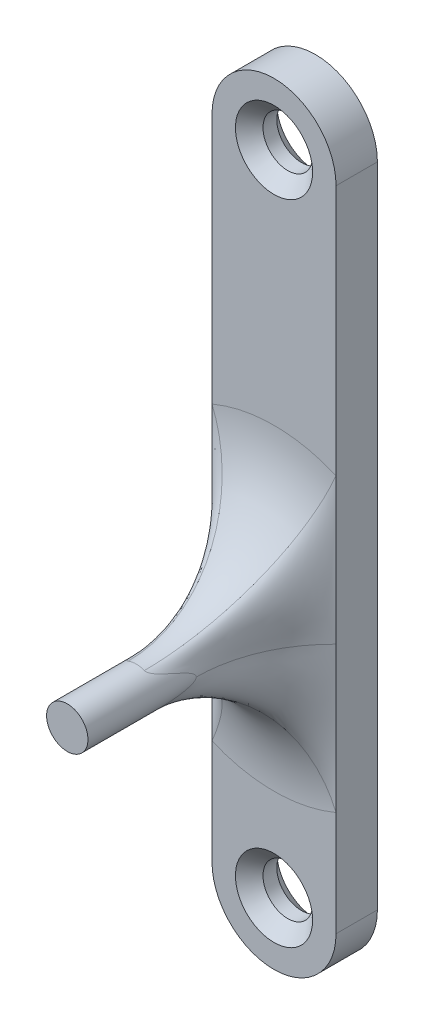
ISO-10303-21;
HEADER;
FILE_DESCRIPTION(('STEP AP214'),'2;1');
FILE_NAME('part.step','',(''),(''),'','','');
FILE_SCHEMA(('AUTOMOTIVE_DESIGN { 1 0 10303 214 1 1 1 1 }'));
ENDSEC;
DATA;
#1=APPLICATION_CONTEXT('core data for automotive mechanical design processes');
#2=APPLICATION_PROTOCOL_DEFINITION('international standard','automotive_design',2000,#1);
#3=PRODUCT_CONTEXT('',#1,'mechanical');
#4=PRODUCT('Part','Part','',(#3));
#5=PRODUCT_RELATED_PRODUCT_CATEGORY('part','',(#4));
#6=PRODUCT_DEFINITION_FORMATION('','',#4);
#7=PRODUCT_DEFINITION_CONTEXT('part definition',#1,'design');
#8=PRODUCT_DEFINITION('design','',#6,#7);
#9=PRODUCT_DEFINITION_SHAPE('','',#8);
#10=(LENGTH_UNIT() NAMED_UNIT(*) SI_UNIT(.MILLI.,.METRE.));
#11=(NAMED_UNIT(*) PLANE_ANGLE_UNIT() SI_UNIT($,.RADIAN.));
#12=(NAMED_UNIT(*) SI_UNIT($,.STERADIAN.) SOLID_ANGLE_UNIT());
#13=UNCERTAINTY_MEASURE_WITH_UNIT(LENGTH_MEASURE(1.E-05),#10,'distance_accuracy_value','');
#14=(GEOMETRIC_REPRESENTATION_CONTEXT(3) GLOBAL_UNCERTAINTY_ASSIGNED_CONTEXT((#13)) GLOBAL_UNIT_ASSIGNED_CONTEXT((#10,
#11,#12)) REPRESENTATION_CONTEXT('',''));
#15=CARTESIAN_POINT('',(0.,0.,0.));
#16=DIRECTION('',(0.,0.,1.));
#17=DIRECTION('',(1.,0.,0.));
#18=AXIS2_PLACEMENT_3D('',#15,#16,#17);
#19=CARTESIAN_POINT('',(21.2130434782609,-6.68039198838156,13.));
#20=CARTESIAN_POINT('',(21.1458591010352,-6.65182451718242,13.000000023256));
#21=CARTESIAN_POINT('',(21.0807643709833,-6.61834412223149,12.9601706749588));
#22=CARTESIAN_POINT('',(20.9561236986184,-6.54225758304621,12.8159915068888));
#23=CARTESIAN_POINT('',(20.896578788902,-6.49965185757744,12.7115965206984));
#24=CARTESIAN_POINT('',(20.7843028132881,-6.40620689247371,12.4550118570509));
#25=CARTESIAN_POINT('',(20.7315726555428,-6.3553681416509,12.3027886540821));
#26=CARTESIAN_POINT('',(20.6340565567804,-6.24652775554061,11.9701486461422));
#27=CARTESIAN_POINT('',(20.5892715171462,-6.18852677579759,11.7897165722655));
#28=CARTESIAN_POINT('',(20.4682858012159,-6.00562770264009,11.2410119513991));
#29=CARTESIAN_POINT('',(20.4055631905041,-5.87178179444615,10.8648794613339));
#30=CARTESIAN_POINT('',(20.3213785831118,-5.59166271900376,10.3108580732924));
#31=CARTESIAN_POINT('',(20.2999301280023,-5.44545267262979,10.1409033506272));
#32=CARTESIAN_POINT('',(20.3000001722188,-5.29928121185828,10.1414297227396));
#33=CARTESIAN_POINT('',(21.2130434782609,-6.68039198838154,2.99999999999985));
#34=CARTESIAN_POINT('',(21.1510907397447,-6.6540490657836,4.21125641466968));
#35=CARTESIAN_POINT('',(21.0823672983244,-6.61935548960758,4.91437720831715));
#36=CARTESIAN_POINT('',(20.9573877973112,-6.54299833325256,5.79988748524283));
#37=CARTESIAN_POINT('',(20.8967827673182,-6.49988205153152,6.04107238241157));
#38=CARTESIAN_POINT('',(20.7843687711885,-6.40620317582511,6.34515492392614));
#39=CARTESIAN_POINT('',(20.7311498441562,-6.35498702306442,6.41328843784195));
#40=CARTESIAN_POINT('',(20.6336020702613,-6.24593111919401,6.46774985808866));
#41=CARTESIAN_POINT('',(20.5886031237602,-6.18764580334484,6.45463711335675));
#42=CARTESIAN_POINT('',(20.468162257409,-6.00518506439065,6.36022782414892));
#43=CARTESIAN_POINT('',(20.4049572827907,-5.87035999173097,6.22543634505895));
#44=CARTESIAN_POINT('',(20.3210569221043,-5.58999924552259,6.01495301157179));
#45=CARTESIAN_POINT('',(20.2997387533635,-5.44356281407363,5.94050415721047));
#46=CARTESIAN_POINT('',(20.3000011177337,-5.29730806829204,5.94058818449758));
#47=CARTESIAN_POINT('',(17.3,-15.8830052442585,3.));
#48=CARTESIAN_POINT('',(17.3,-14.4621496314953,2.99999999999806));
#49=CARTESIAN_POINT('',(17.3,-13.4758052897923,3.));
#50=CARTESIAN_POINT('',(17.3,-11.8609395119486,3.));
#51=CARTESIAN_POINT('',(17.3,-11.2381495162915,3.00000000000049));
#52=CARTESIAN_POINT('',(17.3,-10.1669832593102,2.99999999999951));
#53=CARTESIAN_POINT('',(17.3,-9.7225193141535,2.99999999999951));
#54=CARTESIAN_POINT('',(17.3,-8.93224924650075,3.00000000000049));
#55=CARTESIAN_POINT('',(17.3,-8.58765309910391,3.));
#56=CARTESIAN_POINT('',(17.3,-7.64222345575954,3.));
#57=CARTESIAN_POINT('',(17.3,-7.1270730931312,3.));
#58=CARTESIAN_POINT('',(17.3,-6.17071418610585,3.));
#59=CARTESIAN_POINT('',(17.3,-5.73351343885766,3.00000000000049));
#60=CARTESIAN_POINT('',(17.3,-5.29448929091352,3.));
#61=(BOUNDED_SURFACE() B_SPLINE_SURFACE(2,3,((#19,#20,#21,#22,#23,#24,#25,#26,#27,#28,#29,#30,
#31,#32),(#33,#34,#35,#36,#37,#38,#39,#40,#41,#42,#43,#44,#45,#46),(#47,#48,#49,#50,#51,#52,#53,
#54,#55,#56,#57,#58,#59,#60)),.UNSPECIFIED.,.F.,.F.,.F.) B_SPLINE_SURFACE_WITH_KNOTS((3,3),(4,2,
2,2,2,2,4),(0.,1.),(3.54364113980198,3.68979451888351,3.83594789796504,3.98210127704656,
4.12825465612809,4.42056141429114,4.7128681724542),
.UNSPECIFIED.) GEOMETRIC_REPRESENTATION_ITEM() RATIONAL_B_SPLINE_SURFACE(((1.,1.,1.,1.,1.,1.,1.,
1.,1.,1.,1.,1.,1.,1.),(0.707106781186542,0.753638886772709,0.786181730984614,0.835765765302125,
0.852888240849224,0.879297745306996,0.888504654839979,0.902634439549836,0.90750924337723,
0.918357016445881,0.920614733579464,0.92240169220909,0.921879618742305,0.921954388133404),(1.,
1.,1.,1.,1.,1.,1.,1.,1.,1.,1.,1.,1.,1.))) REPRESENTATION_ITEM('') SURFACE());
#62=CARTESIAN_POINT('',(17.3,-5.29448929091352,3.));
#63=CARTESIAN_POINT('',(20.3000011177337,-5.29730806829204,5.94058818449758));
#64=CARTESIAN_POINT('',(20.3000001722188,-5.29928121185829,10.1414297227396));
#65=(BOUNDED_CURVE() B_SPLINE_CURVE(2,(#62,#63,#64),.UNSPECIFIED.,.F.,
.F.) B_SPLINE_CURVE_WITH_KNOTS((3,3),(0.,1.),
.UNSPECIFIED.) CURVE() GEOMETRIC_REPRESENTATION_ITEM() RATIONAL_B_SPLINE_CURVE((1.,
0.921954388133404,1.)) REPRESENTATION_ITEM(''));
#66=CARTESIAN_POINT('',(17.3,-5.29448929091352,3.));
#67=VERTEX_POINT('',#66);
#68=CARTESIAN_POINT('',(20.3000001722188,-5.29928121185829,10.1414297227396));
#69=VERTEX_POINT('',#68);
#70=EDGE_CURVE('E53',#67,#69,#65,.T.);
#71=CARTESIAN_POINT('',(17.3,-5.29448929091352,3.));
#72=CARTESIAN_POINT('',(17.3,-5.73351343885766,3.00000000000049));
#73=CARTESIAN_POINT('',(17.3,-6.17071418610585,3.));
#74=CARTESIAN_POINT('',(17.3,-7.1270730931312,3.));
#75=CARTESIAN_POINT('',(17.3,-7.64222345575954,3.));
#76=CARTESIAN_POINT('',(17.3,-8.5876530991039,3.));
#77=CARTESIAN_POINT('',(17.3,-8.93224924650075,3.00000000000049));
#78=CARTESIAN_POINT('',(17.3,-9.72251931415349,2.99999999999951));
#79=CARTESIAN_POINT('',(17.3,-10.1669832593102,2.99999999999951));
#80=CARTESIAN_POINT('',(17.3,-11.2381495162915,3.00000000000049));
#81=CARTESIAN_POINT('',(17.3,-11.8609395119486,3.));
#82=CARTESIAN_POINT('',(17.3,-13.4758052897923,3.));
#83=CARTESIAN_POINT('',(17.3,-14.4621496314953,2.99999999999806));
#84=CARTESIAN_POINT('',(17.3,-15.8830052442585,3.));
#85=(BOUNDED_CURVE() B_SPLINE_CURVE(3,(#71,#72,#73,#74,#75,#76,#77,#78,#79,#80,#81,#82,#83,#84),
.UNSPECIFIED.,.F.,.F.) B_SPLINE_CURVE_WITH_KNOTS((4,2,2,2,2,2,4),(3.54364113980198,
3.83594789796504,4.12825465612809,4.27440803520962,4.42056141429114,4.56671479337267,
4.7128681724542),
.UNSPECIFIED.) CURVE() GEOMETRIC_REPRESENTATION_ITEM() RATIONAL_B_SPLINE_CURVE((1.,1.,1.,1.,1.,
1.,1.,1.,1.,1.,1.,1.,1.,1.)) REPRESENTATION_ITEM(''));
#86=CARTESIAN_POINT('',(17.3,-15.8830052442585,3.));
#87=VERTEX_POINT('',#86);
#88=EDGE_CURVE('E129',#67,#87,#85,.T.);
#89=CARTESIAN_POINT('',(17.3,-15.8830052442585,3.));
#90=CARTESIAN_POINT('',(21.2130434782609,-6.68039198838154,2.99999999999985));
#91=CARTESIAN_POINT('',(21.2130434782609,-6.68039198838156,13.));
#92=(BOUNDED_CURVE() B_SPLINE_CURVE(2,(#89,#90,#91),.UNSPECIFIED.,.F.,
.F.) B_SPLINE_CURVE_WITH_KNOTS((3,3),(0.,1.),
.UNSPECIFIED.) CURVE() GEOMETRIC_REPRESENTATION_ITEM() RATIONAL_B_SPLINE_CURVE((1.,
0.707106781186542,1.)) REPRESENTATION_ITEM(''));
#93=CARTESIAN_POINT('',(21.2130434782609,-6.68039198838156,13.));
#94=VERTEX_POINT('',#93);
#95=EDGE_CURVE('E132',#94,#87,#92,.F.);
#96=CARTESIAN_POINT('',(21.2130434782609,-6.68039198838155,13.));
#97=CARTESIAN_POINT('',(21.1458591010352,-6.65182451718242,13.000000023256));
#98=CARTESIAN_POINT('',(21.0807643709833,-6.61834412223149,12.9601706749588));
#99=CARTESIAN_POINT('',(20.9561236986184,-6.54225758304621,12.8159915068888));
#100=CARTESIAN_POINT('',(20.896578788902,-6.49965185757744,12.7115965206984));
#101=CARTESIAN_POINT('',(20.7843028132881,-6.40620689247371,12.4550118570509));
#102=CARTESIAN_POINT('',(20.7315726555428,-6.3553681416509,12.3027886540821));
#103=CARTESIAN_POINT('',(20.6340565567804,-6.24652775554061,11.9701486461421));
#104=CARTESIAN_POINT('',(20.5892715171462,-6.18852677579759,11.7897165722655));
#105=CARTESIAN_POINT('',(20.4682858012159,-6.00562770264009,11.2410119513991));
#106=CARTESIAN_POINT('',(20.4055631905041,-5.87178179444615,10.8648794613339));
#107=CARTESIAN_POINT('',(20.3213785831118,-5.59166271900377,10.3108580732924));
#108=CARTESIAN_POINT('',(20.2999301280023,-5.44545267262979,10.1409033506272));
#109=CARTESIAN_POINT('',(20.3000001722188,-5.29928121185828,10.1414297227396));
#110=(BOUNDED_CURVE() B_SPLINE_CURVE(3,(#96,#97,#98,#99,#100,#101,#102,#103,#104,#105,#106,#107,
#108,#109),.UNSPECIFIED.,.F.,.F.) B_SPLINE_CURVE_WITH_KNOTS((4,2,2,2,2,2,4),(3.54364113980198,
3.68979451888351,3.83594789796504,3.98210127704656,4.12825465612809,4.42056141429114,
4.7128681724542),
.UNSPECIFIED.) CURVE() GEOMETRIC_REPRESENTATION_ITEM() RATIONAL_B_SPLINE_CURVE((1.,1.,1.,1.,1.,
1.,1.,1.,1.,1.,1.,1.,1.,1.)) REPRESENTATION_ITEM(''));
#111=EDGE_CURVE('E72',#69,#94,#110,.F.);
#112=ORIENTED_EDGE('',*,*,#70,.F.);
#113=ORIENTED_EDGE('',*,*,#88,.T.);
#114=ORIENTED_EDGE('',*,*,#95,.F.);
#115=ORIENTED_EDGE('',*,*,#111,.F.);
#116=EDGE_LOOP('',(#112,#113,#114,#115));
#117=FACE_BOUND('',#116,.T.);
#118=ADVANCED_FACE('F36',(#117),#61,.F.);
#119=CARTESIAN_POINT('',(22.3869565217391,-3.91960801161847,13.));
#120=CARTESIAN_POINT('',(22.4541408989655,-3.94817548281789,13.000000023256));
#121=CARTESIAN_POINT('',(22.5192356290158,-3.98165587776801,12.9601706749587));
#122=CARTESIAN_POINT('',(22.6438763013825,-4.05774241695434,12.8159915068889));
#123=CARTESIAN_POINT('',(22.7034212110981,-4.10034814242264,12.7115965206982));
#124=CARTESIAN_POINT('',(22.8156971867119,-4.19379310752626,12.455011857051));
#125=CARTESIAN_POINT('',(22.8684273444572,-4.24463185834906,12.3027886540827));
#126=CARTESIAN_POINT('',(22.9659434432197,-4.35347224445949,11.9701486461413));
#127=CARTESIAN_POINT('',(23.0107284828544,-4.41147322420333,11.7897165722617));
#128=CARTESIAN_POINT('',(23.1317141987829,-4.59437229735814,11.2410119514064));
#129=CARTESIAN_POINT('',(23.1944368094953,-4.72821820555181,10.8648794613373));
#130=CARTESIAN_POINT('',(23.2786214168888,-5.00833728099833,10.310858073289));
#131=CARTESIAN_POINT('',(23.3000698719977,-5.15454732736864,10.1409033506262));
#132=CARTESIAN_POINT('',(23.2999998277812,-5.30071878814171,10.1414297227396));
#133=CARTESIAN_POINT('',(22.3869565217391,-3.91960801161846,2.99999999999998));
#134=CARTESIAN_POINT('',(22.4489092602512,-3.94595093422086,4.21125641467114));
#135=CARTESIAN_POINT('',(22.5176327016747,-3.98064451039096,4.91437720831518));
#136=CARTESIAN_POINT('',(22.6426122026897,-4.05700166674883,5.79988748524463));
#137=CARTESIAN_POINT('',(22.7032172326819,-4.10011794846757,6.04107238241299));
#138=CARTESIAN_POINT('',(22.8156312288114,-4.19379682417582,6.34515492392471));
#139=CARTESIAN_POINT('',(22.8688501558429,-4.24501297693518,6.41328843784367));
#140=CARTESIAN_POINT('',(22.9663979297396,-4.35406888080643,6.46774985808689));
#141=CARTESIAN_POINT('',(23.0113968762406,-4.41235419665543,6.45463711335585));
#142=CARTESIAN_POINT('',(23.1318377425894,-4.59481493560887,6.36022782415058));
#143=CARTESIAN_POINT('',(23.195042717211,-4.72964000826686,6.22543634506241));
#144=CARTESIAN_POINT('',(23.278943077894,-5.01000075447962,6.01495301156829));
#145=CARTESIAN_POINT('',(23.3002612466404,-5.15643718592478,5.9405041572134));
#146=CARTESIAN_POINT('',(23.2999988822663,-5.30269193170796,5.94058818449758));
#147=CARTESIAN_POINT('',(26.3,5.28300524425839,3.));
#148=CARTESIAN_POINT('',(26.3,3.86214963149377,2.99999999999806));
#149=CARTESIAN_POINT('',(26.3,2.87580528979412,3.));
#150=CARTESIAN_POINT('',(26.3,1.26093951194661,3.));
#151=CARTESIAN_POINT('',(26.3,0.638149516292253,3.00000000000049));
#152=CARTESIAN_POINT('',(26.3,-0.433016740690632,2.99999999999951));
#153=CARTESIAN_POINT('',(26.3,-0.877480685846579,3.));
#154=CARTESIAN_POINT('',(26.3,-1.66775075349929,3.));
#155=CARTESIAN_POINT('',(26.3,-2.0123469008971,3.));
#156=CARTESIAN_POINT('',(26.3,-2.9577765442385,3.));
#157=CARTESIAN_POINT('',(26.3,-3.47292690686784,3.00000000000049));
#158=CARTESIAN_POINT('',(26.3,-4.42928581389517,2.99999999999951));
#159=CARTESIAN_POINT('',(26.3,-4.86648656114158,3.00000000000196));
#160=CARTESIAN_POINT('',(26.3,-5.30551070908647,3.));
#161=(BOUNDED_SURFACE() B_SPLINE_SURFACE(2,3,((#119,#120,#121,#122,#123,#124,#125,#126,#127,
#128,#129,#130,#131,#132),(#133,#134,#135,#136,#137,#138,#139,#140,#141,#142,#143,#144,#145,
#146),(#147,#148,#149,#150,#151,#152,#153,#154,#155,#156,#157,#158,#159,#160)),.UNSPECIFIED.,
.F.,.F.,.F.) B_SPLINE_SURFACE_WITH_KNOTS((3,3),(4,2,2,2,2,2,4),(0.,1.),(0.402048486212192,
0.548201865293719,0.694355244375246,0.840508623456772,0.986662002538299,1.27896876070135,
1.57127551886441),.UNSPECIFIED.) GEOMETRIC_REPRESENTATION_ITEM() RATIONAL_B_SPLINE_SURFACE(((1.,
1.,1.,1.,1.,1.,1.,1.,1.,1.,1.,1.,1.,1.),(0.707106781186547,0.753638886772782,0.786181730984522,
0.835765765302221,0.852888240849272,0.879297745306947,0.888504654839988,0.902634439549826,
0.907509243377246,0.918357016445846,0.920614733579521,0.922401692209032,0.921879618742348,
0.921954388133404),(1.,1.,1.,1.,1.,1.,1.,1.,1.,1.,1.,1.,1.,1.))) REPRESENTATION_ITEM('') SURFACE());
#162=CARTESIAN_POINT('',(26.3,-5.30551070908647,3.));
#163=CARTESIAN_POINT('',(23.2999988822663,-5.30269193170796,5.94058818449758));
#164=CARTESIAN_POINT('',(23.2999998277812,-5.30071878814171,10.1414297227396));
#165=(BOUNDED_CURVE() B_SPLINE_CURVE(2,(#162,#163,#164),.UNSPECIFIED.,.F.,
.F.) B_SPLINE_CURVE_WITH_KNOTS((3,3),(0.,1.),
.UNSPECIFIED.) CURVE() GEOMETRIC_REPRESENTATION_ITEM() RATIONAL_B_SPLINE_CURVE((1.,
0.921954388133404,1.)) REPRESENTATION_ITEM(''));
#166=CARTESIAN_POINT('',(26.3,-5.30551070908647,3.));
#167=VERTEX_POINT('',#166);
#168=CARTESIAN_POINT('',(23.2999998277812,-5.30071878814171,10.1414297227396));
#169=VERTEX_POINT('',#168);
#170=EDGE_CURVE('E148',#167,#169,#165,.T.);
#171=CARTESIAN_POINT('',(26.3,-5.30551070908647,3.));
#172=CARTESIAN_POINT('',(26.3,-5.15884350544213,3.00000000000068));
#173=CARTESIAN_POINT('',(26.3,-5.01217630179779,3.00000000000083));
#174=CARTESIAN_POINT('',(26.3,-4.71607656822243,3.00000000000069));
#175=CARTESIAN_POINT('',(26.3,-4.5666440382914,3.0000000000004));
#176=CARTESIAN_POINT('',(26.3,-4.26184312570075,3.00000000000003));
#177=CARTESIAN_POINT('',(26.3,-4.10647474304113,2.99999999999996));
#178=CARTESIAN_POINT('',(26.3,-3.78664032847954,3.00000000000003));
#179=CARTESIAN_POINT('',(26.3,-3.62217429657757,3.00000000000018));
#180=CARTESIAN_POINT('',(26.3,-3.27923646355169,3.00000000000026));
#181=CARTESIAN_POINT('',(26.3,-3.10076466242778,3.00000000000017));
#182=CARTESIAN_POINT('',(26.3,-2.72402527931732,3.00000000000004));
#183=CARTESIAN_POINT('',(26.3,-2.52575769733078,3.00000000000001));
#184=CARTESIAN_POINT('',(26.3,-2.10222188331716,2.99999999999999));
#185=CARTESIAN_POINT('',(26.3,-1.87695365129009,3.00000000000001));
#186=CARTESIAN_POINT('',(26.3,-1.38762025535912,2.99999999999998));
#187=CARTESIAN_POINT('',(26.3,-1.12355509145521,2.99999999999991));
#188=CARTESIAN_POINT('',(26.3,-0.5388044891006,2.99999999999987));
#189=CARTESIAN_POINT('',(26.3,-0.218119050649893,2.99999999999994));
#190=CARTESIAN_POINT('',(26.3,0.508003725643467,3.00000000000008));
#191=CARTESIAN_POINT('',(26.3,0.913441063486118,3.00000000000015));
#192=CARTESIAN_POINT('',(26.3,1.86088863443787,3.00000000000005));
#193=CARTESIAN_POINT('',(26.3,2.40289886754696,2.99999999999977));
#194=CARTESIAN_POINT('',(26.3,3.72427448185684,2.99999999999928));
#195=CARTESIAN_POINT('',(26.3,4.50363986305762,2.99999999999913));
#196=CARTESIAN_POINT('',(26.3,5.2830052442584,3.));
#197=B_SPLINE_CURVE_WITH_KNOTS('',3,(#171,#172,#173,#174,#175,#176,#177,#178,#179,#180,#181,
#182,#183,#184,#185,#186,#187,#188,#189,#190,#191,#192,#193,#194,#195,#196),.UNSPECIFIED.,.F.,
.F.,(4,2,2,2,2,2,2,2,2,2,2,2,4),(0.,0.440001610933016,0.888299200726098,1.35440434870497,
1.84780244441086,2.3832178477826,2.97802059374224,3.65382528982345,4.44602078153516,
5.40807709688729,6.62438911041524,8.25041980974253,10.5885159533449),.UNSPECIFIED.);
#198=CARTESIAN_POINT('',(26.3,5.28300524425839,3.));
#199=VERTEX_POINT('',#198);
#200=EDGE_CURVE('E117',#167,#199,#197,.T.);
#201=CARTESIAN_POINT('',(26.3,5.28300524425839,3.));
#202=CARTESIAN_POINT('',(22.3869565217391,-3.91960801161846,2.99999999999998));
#203=CARTESIAN_POINT('',(22.3869565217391,-3.91960801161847,13.));
#204=(BOUNDED_CURVE() B_SPLINE_CURVE(2,(#201,#202,#203),.UNSPECIFIED.,.F.,
.F.) B_SPLINE_CURVE_WITH_KNOTS((3,3),(0.,1.),
.UNSPECIFIED.) CURVE() GEOMETRIC_REPRESENTATION_ITEM() RATIONAL_B_SPLINE_CURVE((1.,
0.707106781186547,1.)) REPRESENTATION_ITEM(''));
#205=CARTESIAN_POINT('',(22.3869565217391,-3.91960801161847,13.));
#206=VERTEX_POINT('',#205);
#207=EDGE_CURVE('E266',#199,#206,#204,.T.);
#208=CARTESIAN_POINT('',(22.3869565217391,-3.91960801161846,13.));
#209=CARTESIAN_POINT('',(22.4541408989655,-3.94817548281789,13.000000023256));
#210=CARTESIAN_POINT('',(22.5192356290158,-3.98165587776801,12.9601706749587));
#211=CARTESIAN_POINT('',(22.6438763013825,-4.05774241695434,12.8159915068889));
#212=CARTESIAN_POINT('',(22.7034212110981,-4.10034814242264,12.7115965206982));
#213=CARTESIAN_POINT('',(22.8156971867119,-4.19379310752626,12.455011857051));
#214=CARTESIAN_POINT('',(22.8684273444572,-4.24463185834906,12.3027886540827));
#215=CARTESIAN_POINT('',(22.9659434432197,-4.35347224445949,11.9701486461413));
#216=CARTESIAN_POINT('',(23.0107284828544,-4.41147322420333,11.7897165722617));
#217=CARTESIAN_POINT('',(23.1317141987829,-4.59437229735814,11.2410119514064));
#218=CARTESIAN_POINT('',(23.1944368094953,-4.7282182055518,10.8648794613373));
#219=CARTESIAN_POINT('',(23.2786214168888,-5.00833728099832,10.310858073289));
#220=CARTESIAN_POINT('',(23.3000698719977,-5.15454732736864,10.1409033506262));
#221=CARTESIAN_POINT('',(23.2999998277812,-5.30071878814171,10.1414297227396));
#222=(BOUNDED_CURVE() B_SPLINE_CURVE(3,(#208,#209,#210,#211,#212,#213,#214,#215,#216,#217,#218,
#219,#220,#221),.UNSPECIFIED.,.F.,.F.) B_SPLINE_CURVE_WITH_KNOTS((4,2,2,2,2,2,4),
(0.402048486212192,0.548201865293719,0.694355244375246,0.840508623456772,0.986662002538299,
1.27896876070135,1.57127551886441),
.UNSPECIFIED.) CURVE() GEOMETRIC_REPRESENTATION_ITEM() RATIONAL_B_SPLINE_CURVE((1.,1.,1.,1.,1.,
1.,1.,1.,1.,1.,1.,1.,1.,1.)) REPRESENTATION_ITEM(''));
#223=EDGE_CURVE('E395',#169,#206,#222,.F.);
#224=ORIENTED_EDGE('',*,*,#170,.F.);
#225=ORIENTED_EDGE('',*,*,#200,.T.);
#226=ORIENTED_EDGE('',*,*,#207,.T.);
#227=ORIENTED_EDGE('',*,*,#223,.F.);
#228=EDGE_LOOP('',(#224,#225,#226,#227));
#229=FACE_BOUND('',#228,.T.);
#230=ADVANCED_FACE('F272',(#229),#161,.F.);
#231=CARTESIAN_POINT('',(21.8,-23.5,3.));
#232=DIRECTION('',(0.,0.,1.));
#233=DIRECTION('',(1.,0.,0.));
#234=AXIS2_PLACEMENT_3D('',#231,#232,#233);
#235=PLANE('',#234);
#236=CARTESIAN_POINT('',(21.8,-23.5,3.));
#237=DIRECTION('',(0.,0.,1.));
#238=DIRECTION('',(1.,0.,0.));
#239=AXIS2_PLACEMENT_3D('',#236,#237,#238);
#240=CIRCLE('',#239,2.80000000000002);
#241=CARTESIAN_POINT('',(24.6,-23.5,3.));
#242=VERTEX_POINT('',#241);
#243=EDGE_CURVE('E11',#242,#242,#240,.F.);
#244=ORIENTED_EDGE('',*,*,#243,.T.);
#245=EDGE_LOOP('',(#244));
#246=FACE_BOUND('',#245,.T.);
#247=DIRECTION('',(0.,1.,0.));
#248=VECTOR('',#247,1.);
#249=CARTESIAN_POINT('',(26.3,-23.5,3.));
#250=LINE('',#249,#248);
#251=CARTESIAN_POINT('',(26.3,-23.5,3.));
#252=VERTEX_POINT('',#251);
#253=CARTESIAN_POINT('',(26.3,-15.8830052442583,3.));
#254=VERTEX_POINT('',#253);
#255=EDGE_CURVE('E144',#252,#254,#250,.T.);
#256=ORIENTED_EDGE('',*,*,#255,.T.);
#257=CARTESIAN_POINT('',(21.8,-5.3,3.));
#258=DIRECTION('',(0.,0.,1.));
#259=DIRECTION('',(1.,0.,0.));
#260=AXIS2_PLACEMENT_3D('',#257,#258,#259);
#261=CIRCLE('',#260,11.5);
#262=EDGE_CURVE('E141',#254,#87,#261,.F.);
#263=ORIENTED_EDGE('',*,*,#262,.T.);
#264=DIRECTION('',(0.,-1.,0.));
#265=VECTOR('',#264,1.);
#266=CARTESIAN_POINT('',(17.3,-23.5,3.));
#267=LINE('',#266,#265);
#268=CARTESIAN_POINT('',(17.3,-23.5,3.));
#269=VERTEX_POINT('',#268);
#270=EDGE_CURVE('E83',#87,#269,#267,.T.);
#271=ORIENTED_EDGE('',*,*,#270,.T.);
#272=CARTESIAN_POINT('',(21.8,-23.5,3.));
#273=DIRECTION('',(0.,0.,1.));
#274=DIRECTION('',(1.,0.,0.));
#275=AXIS2_PLACEMENT_3D('',#272,#273,#274);
#276=CIRCLE('',#275,4.5);
#277=EDGE_CURVE('E208',#269,#252,#276,.T.);
#278=ORIENTED_EDGE('',*,*,#277,.T.);
#279=EDGE_LOOP('',(#256,#263,#271,#278));
#280=FACE_BOUND('',#279,.T.);
#281=ADVANCED_FACE('F142',(#246,#280),#235,.T.);
#282=CARTESIAN_POINT('',(21.8,23.5,3.));
#283=DIRECTION('',(0.,0.,1.));
#284=DIRECTION('',(1.,0.,0.));
#285=AXIS2_PLACEMENT_3D('',#282,#283,#284);
#286=CIRCLE('',#285,2.80000000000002);
#287=CARTESIAN_POINT('',(24.6,23.5,3.));
#288=VERTEX_POINT('',#287);
#289=EDGE_CURVE('E492',#288,#288,#286,.F.);
#290=ORIENTED_EDGE('',*,*,#289,.T.);
#291=EDGE_LOOP('',(#290));
#292=FACE_BOUND('',#291,.T.);
#293=CARTESIAN_POINT('',(17.3,23.5,3.));
#294=VERTEX_POINT('',#293);
#295=CARTESIAN_POINT('',(17.3,5.28300524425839,3.));
#296=VERTEX_POINT('',#295);
#297=EDGE_CURVE('E314',#294,#296,#267,.T.);
#298=ORIENTED_EDGE('',*,*,#297,.T.);
#299=CARTESIAN_POINT('',(21.8,-5.3,3.));
#300=DIRECTION('',(0.,0.,1.));
#301=DIRECTION('',(1.,0.,0.));
#302=AXIS2_PLACEMENT_3D('',#299,#300,#301);
#303=CIRCLE('',#302,11.5);
#304=EDGE_CURVE('E149',#296,#199,#303,.F.);
#305=ORIENTED_EDGE('',*,*,#304,.T.);
#306=CARTESIAN_POINT('',(26.3,23.5,3.));
#307=VERTEX_POINT('',#306);
#308=EDGE_CURVE('E204',#199,#307,#250,.T.);
#309=ORIENTED_EDGE('',*,*,#308,.T.);
#310=CARTESIAN_POINT('',(21.8,23.5,3.));
#311=DIRECTION('',(0.,0.,1.));
#312=DIRECTION('',(1.,0.,0.));
#313=AXIS2_PLACEMENT_3D('',#310,#311,#312);
#314=CIRCLE('',#313,4.5);
#315=EDGE_CURVE('E155',#307,#294,#314,.T.);
#316=ORIENTED_EDGE('',*,*,#315,.T.);
#317=EDGE_LOOP('',(#298,#305,#309,#316));
#318=FACE_BOUND('',#317,.T.);
#319=ADVANCED_FACE('F512',(#292,#318),#235,.T.);
#320=CARTESIAN_POINT('',(21.8,-23.5,0.));
#321=DIRECTION('',(0.,0.,1.));
#322=DIRECTION('',(1.,0.,0.));
#323=AXIS2_PLACEMENT_3D('',#320,#321,#322);
#324=PLANE('',#323);
#325=CARTESIAN_POINT('',(21.8,23.5,0.));
#326=DIRECTION('',(0.,0.,1.));
#327=DIRECTION('',(1.,0.,0.));
#328=AXIS2_PLACEMENT_3D('',#325,#326,#327);
#329=CIRCLE('',#328,2.8);
#330=CARTESIAN_POINT('',(24.6,23.5,0.));
#331=VERTEX_POINT('',#330);
#332=EDGE_CURVE('E483',#331,#331,#329,.T.);
#333=ORIENTED_EDGE('',*,*,#332,.T.);
#334=EDGE_LOOP('',(#333));
#335=FACE_BOUND('',#334,.T.);
#336=CARTESIAN_POINT('',(21.8,-23.5,0.));
#337=DIRECTION('',(0.,0.,1.));
#338=DIRECTION('',(1.,0.,0.));
#339=AXIS2_PLACEMENT_3D('',#336,#337,#338);
#340=CIRCLE('',#339,2.8);
#341=CARTESIAN_POINT('',(24.6,-23.5,0.));
#342=VERTEX_POINT('',#341);
#343=EDGE_CURVE('E475',#342,#342,#340,.T.);
#344=ORIENTED_EDGE('',*,*,#343,.T.);
#345=EDGE_LOOP('',(#344));
#346=FACE_BOUND('',#345,.T.);
#347=CARTESIAN_POINT('',(21.8,-23.5,0.));
#348=DIRECTION('',(0.,0.,1.));
#349=DIRECTION('',(1.,0.,0.));
#350=AXIS2_PLACEMENT_3D('',#347,#348,#349);
#351=CIRCLE('',#350,4.5);
#352=CARTESIAN_POINT('',(17.3,-23.5,0.));
#353=VERTEX_POINT('',#352);
#354=CARTESIAN_POINT('',(26.3,-23.5,0.));
#355=VERTEX_POINT('',#354);
#356=EDGE_CURVE('E324',#353,#355,#351,.T.);
#357=ORIENTED_EDGE('',*,*,#356,.F.);
#358=DIRECTION('',(0.,-1.,0.));
#359=VECTOR('',#358,1.);
#360=CARTESIAN_POINT('',(17.3,-23.5,0.));
#361=LINE('',#360,#359);
#362=CARTESIAN_POINT('',(17.3,23.5,0.));
#363=VERTEX_POINT('',#362);
#364=EDGE_CURVE('E419',#363,#353,#361,.T.);
#365=ORIENTED_EDGE('',*,*,#364,.F.);
#366=CARTESIAN_POINT('',(21.8,23.5,0.));
#367=DIRECTION('',(0.,0.,1.));
#368=DIRECTION('',(1.,0.,0.));
#369=AXIS2_PLACEMENT_3D('',#366,#367,#368);
#370=CIRCLE('',#369,4.5);
#371=CARTESIAN_POINT('',(26.3,23.5,0.));
#372=VERTEX_POINT('',#371);
#373=EDGE_CURVE('E421',#372,#363,#370,.T.);
#374=ORIENTED_EDGE('',*,*,#373,.F.);
#375=DIRECTION('',(0.,1.,0.));
#376=VECTOR('',#375,1.);
#377=CARTESIAN_POINT('',(26.3,-23.5,0.));
#378=LINE('',#377,#376);
#379=EDGE_CURVE('E422',#355,#372,#378,.T.);
#380=ORIENTED_EDGE('',*,*,#379,.F.);
#381=EDGE_LOOP('',(#357,#365,#374,#380));
#382=FACE_BOUND('',#381,.T.);
#383=ADVANCED_FACE('F509',(#335,#346,#382),#324,.F.);
#384=CARTESIAN_POINT('',(21.8,-23.5,3.));
#385=DIRECTION('',(0.,0.,-1.));
#386=DIRECTION('',(-1.,0.,0.));
#387=AXIS2_PLACEMENT_3D('',#384,#385,#386);
#388=CYLINDRICAL_SURFACE('',#387,4.5);
#389=ORIENTED_EDGE('',*,*,#356,.T.);
#390=DIRECTION('',(0.,0.,-1.));
#391=VECTOR('',#390,1.);
#392=CARTESIAN_POINT('',(26.3,-23.5,3.));
#393=LINE('',#392,#391);
#394=EDGE_CURVE('E405',#252,#355,#393,.T.);
#395=ORIENTED_EDGE('',*,*,#394,.F.);
#396=ORIENTED_EDGE('',*,*,#277,.F.);
#397=DIRECTION('',(0.,0.,-1.));
#398=VECTOR('',#397,1.);
#399=CARTESIAN_POINT('',(17.3,-23.5,3.));
#400=LINE('',#399,#398);
#401=EDGE_CURVE('E153',#269,#353,#400,.T.);
#402=ORIENTED_EDGE('',*,*,#401,.T.);
#403=EDGE_LOOP('',(#389,#395,#396,#402));
#404=FACE_BOUND('',#403,.T.);
#405=ADVANCED_FACE('F250',(#404),#388,.T.);
#406=CARTESIAN_POINT('',(26.3,-23.5,3.));
#407=DIRECTION('',(-1.,0.,0.));
#408=DIRECTION('',(0.,0.,1.));
#409=AXIS2_PLACEMENT_3D('',#406,#407,#408);
#410=PLANE('',#409);
#411=ORIENTED_EDGE('',*,*,#379,.T.);
#412=DIRECTION('',(0.,0.,-1.));
#413=VECTOR('',#412,1.);
#414=CARTESIAN_POINT('',(26.3,23.5,3.));
#415=LINE('',#414,#413);
#416=EDGE_CURVE('E408',#307,#372,#415,.T.);
#417=ORIENTED_EDGE('',*,*,#416,.F.);
#418=ORIENTED_EDGE('',*,*,#308,.F.);
#419=ORIENTED_EDGE('',*,*,#200,.F.);
#420=CARTESIAN_POINT('',(26.3,-15.8830052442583,3.));
#421=CARTESIAN_POINT('',(26.3,-14.4641922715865,3.));
#422=CARTESIAN_POINT('',(26.3,-13.4789704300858,3.));
#423=CARTESIAN_POINT('',(26.3,-11.8658179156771,3.));
#424=CARTESIAN_POINT('',(26.3,-11.2435953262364,3.));
#425=CARTESIAN_POINT('',(26.3,-10.1733694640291,3.));
#426=CARTESIAN_POINT('',(26.3,-9.72926775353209,3.00000000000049));
#427=CARTESIAN_POINT('',(26.3,-8.93963759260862,2.99999999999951));
#428=CARTESIAN_POINT('',(26.3,-8.59531642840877,3.));
#429=CARTESIAN_POINT('',(26.3,-7.65066172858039,3.));
#430=CARTESIAN_POINT('',(26.3,-7.13596272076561,3.00000000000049));
#431=CARTESIAN_POINT('',(26.3,-6.18058023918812,2.99999999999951));
#432=CARTESIAN_POINT('',(26.3,-5.7438987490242,3.00000000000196));
#433=CARTESIAN_POINT('',(26.3,-5.30551070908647,3.));
#434=(BOUNDED_CURVE() B_SPLINE_CURVE(3,(#420,#421,#422,#423,#424,#425,#426,#427,#428,#429,#430,
#431,#432,#433),.UNSPECIFIED.,.F.,.F.) B_SPLINE_CURVE_WITH_KNOTS((4,2,2,2,2,2,4),
(1.57127551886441,1.71730909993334,1.86334268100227,2.00937626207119,2.15540984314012,
2.44747700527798,2.73954416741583),
.UNSPECIFIED.) CURVE() GEOMETRIC_REPRESENTATION_ITEM() RATIONAL_B_SPLINE_CURVE((1.,1.,1.,1.,1.,
1.,1.,1.,1.,1.,1.,1.,1.,1.)) REPRESENTATION_ITEM(''));
#435=EDGE_CURVE('E220',#254,#167,#434,.T.);
#436=ORIENTED_EDGE('',*,*,#435,.F.);
#437=ORIENTED_EDGE('',*,*,#255,.F.);
#438=ORIENTED_EDGE('',*,*,#394,.T.);
#439=EDGE_LOOP('',(#411,#417,#418,#419,#436,#437,#438));
#440=FACE_BOUND('',#439,.T.);
#441=ADVANCED_FACE('F240',(#440),#410,.F.);
#442=CARTESIAN_POINT('',(21.8,23.5,3.));
#443=DIRECTION('',(0.,0.,-1.));
#444=DIRECTION('',(-1.,0.,0.));
#445=AXIS2_PLACEMENT_3D('',#442,#443,#444);
#446=CYLINDRICAL_SURFACE('',#445,4.5);
#447=ORIENTED_EDGE('',*,*,#373,.T.);
#448=DIRECTION('',(0.,0.,-1.));
#449=VECTOR('',#448,1.);
#450=CARTESIAN_POINT('',(17.3,23.5,3.));
#451=LINE('',#450,#449);
#452=EDGE_CURVE('E415',#294,#363,#451,.T.);
#453=ORIENTED_EDGE('',*,*,#452,.F.);
#454=ORIENTED_EDGE('',*,*,#315,.F.);
#455=ORIENTED_EDGE('',*,*,#416,.T.);
#456=EDGE_LOOP('',(#447,#453,#454,#455));
#457=FACE_BOUND('',#456,.T.);
#458=ADVANCED_FACE('F249',(#457),#446,.T.);
#459=CARTESIAN_POINT('',(17.3,-23.5,3.));
#460=DIRECTION('',(1.,0.,0.));
#461=DIRECTION('',(0.,0.,-1.));
#462=AXIS2_PLACEMENT_3D('',#459,#460,#461);
#463=PLANE('',#462);
#464=ORIENTED_EDGE('',*,*,#364,.T.);
#465=ORIENTED_EDGE('',*,*,#401,.F.);
#466=ORIENTED_EDGE('',*,*,#270,.F.);
#467=ORIENTED_EDGE('',*,*,#88,.F.);
#468=CARTESIAN_POINT('',(17.3,5.28300524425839,3.));
#469=CARTESIAN_POINT('',(17.3,3.86419227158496,3.));
#470=CARTESIAN_POINT('',(17.3,2.87897043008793,2.99999999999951));
#471=CARTESIAN_POINT('',(17.3,1.26581791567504,3.00000000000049));
#472=CARTESIAN_POINT('',(17.3,0.643595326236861,3.));
#473=CARTESIAN_POINT('',(17.3,-0.426630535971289,3.));
#474=CARTESIAN_POINT('',(17.3,-0.870732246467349,3.00000000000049));
#475=CARTESIAN_POINT('',(17.3,-1.6603624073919,2.99999999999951));
#476=CARTESIAN_POINT('',(17.3,-2.00468357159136,3.));
#477=CARTESIAN_POINT('',(17.3,-2.94933827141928,3.));
#478=CARTESIAN_POINT('',(17.3,-3.46403727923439,3.));
#479=CARTESIAN_POINT('',(17.3,-4.41941976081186,3.));
#480=CARTESIAN_POINT('',(17.3,-4.8561012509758,2.99999999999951));
#481=CARTESIAN_POINT('',(17.3,-5.29448929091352,3.));
#482=(BOUNDED_CURVE() B_SPLINE_CURVE(3,(#468,#469,#470,#471,#472,#473,#474,#475,#476,#477,#478,
#479,#480,#481),.UNSPECIFIED.,.F.,.F.) B_SPLINE_CURVE_WITH_KNOTS((4,2,2,2,2,2,4),
(4.71286817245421,4.85890175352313,5.00493533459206,5.15096891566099,5.29700249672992,
5.58906965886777,5.88113682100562),
.UNSPECIFIED.) CURVE() GEOMETRIC_REPRESENTATION_ITEM() RATIONAL_B_SPLINE_CURVE((1.,1.,1.,1.,1.,
1.,1.,1.,1.,1.,1.,1.,1.,1.)) REPRESENTATION_ITEM(''));
#483=EDGE_CURVE('E124',#296,#67,#482,.T.);
#484=ORIENTED_EDGE('',*,*,#483,.F.);
#485=ORIENTED_EDGE('',*,*,#297,.F.);
#486=ORIENTED_EDGE('',*,*,#452,.T.);
#487=EDGE_LOOP('',(#464,#465,#466,#467,#484,#485,#486));
#488=FACE_BOUND('',#487,.T.);
#489=ADVANCED_FACE('F151',(#488),#463,.F.);
#490=CARTESIAN_POINT('',(21.8,-23.5,3.));
#491=DIRECTION('',(0.,0.,-1.));
#492=DIRECTION('',(-1.,0.,0.));
#493=AXIS2_PLACEMENT_3D('',#490,#491,#492);
#494=CYLINDRICAL_SURFACE('',#493,1.8);
#495=CARTESIAN_POINT('',(21.8,-23.5,1.));
#496=DIRECTION('',(0.,0.,1.));
#497=DIRECTION('',(1.,0.,0.));
#498=AXIS2_PLACEMENT_3D('',#495,#496,#497);
#499=CIRCLE('',#498,1.8);
#500=CARTESIAN_POINT('',(23.6,-23.5,1.));
#501=VERTEX_POINT('',#500);
#502=EDGE_CURVE('E45',#501,#501,#499,.F.);
#503=ORIENTED_EDGE('',*,*,#502,.T.);
#504=EDGE_LOOP('',(#503));
#505=FACE_BOUND('',#504,.T.);
#506=CARTESIAN_POINT('',(21.8,-23.5,1.99999999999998));
#507=DIRECTION('',(0.,0.,1.));
#508=DIRECTION('',(1.,0.,0.));
#509=AXIS2_PLACEMENT_3D('',#506,#507,#508);
#510=CIRCLE('',#509,1.8);
#511=CARTESIAN_POINT('',(23.6,-23.5,1.99999999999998));
#512=VERTEX_POINT('',#511);
#513=EDGE_CURVE('E495',#512,#512,#510,.T.);
#514=ORIENTED_EDGE('',*,*,#513,.T.);
#515=EDGE_LOOP('',(#514));
#516=FACE_BOUND('',#515,.T.);
#517=ADVANCED_FACE('F500',(#505,#516),#494,.F.);
#518=CARTESIAN_POINT('',(21.8,23.5,3.));
#519=DIRECTION('',(0.,0.,-1.));
#520=DIRECTION('',(-1.,0.,0.));
#521=AXIS2_PLACEMENT_3D('',#518,#519,#520);
#522=CYLINDRICAL_SURFACE('',#521,1.8);
#523=CARTESIAN_POINT('',(21.8,23.5,1.));
#524=DIRECTION('',(0.,0.,1.));
#525=DIRECTION('',(1.,0.,0.));
#526=AXIS2_PLACEMENT_3D('',#523,#524,#525);
#527=CIRCLE('',#526,1.8);
#528=CARTESIAN_POINT('',(23.6,23.5,1.));
#529=VERTEX_POINT('',#528);
#530=EDGE_CURVE('E489',#529,#529,#527,.F.);
#531=ORIENTED_EDGE('',*,*,#530,.T.);
#532=EDGE_LOOP('',(#531));
#533=FACE_BOUND('',#532,.T.);
#534=CARTESIAN_POINT('',(21.8,23.5,1.99999999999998));
#535=DIRECTION('',(0.,0.,1.));
#536=DIRECTION('',(1.,0.,0.));
#537=AXIS2_PLACEMENT_3D('',#534,#535,#536);
#538=CIRCLE('',#537,1.8);
#539=CARTESIAN_POINT('',(23.6,23.5,1.99999999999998));
#540=VERTEX_POINT('',#539);
#541=EDGE_CURVE('E486',#540,#540,#538,.T.);
#542=ORIENTED_EDGE('',*,*,#541,.T.);
#543=EDGE_LOOP('',(#542));
#544=FACE_BOUND('',#543,.T.);
#545=ADVANCED_FACE('F376',(#533,#544),#522,.F.);
#546=CARTESIAN_POINT('',(21.8,-5.3,18.));
#547=DIRECTION('',(0.,0.,-1.));
#548=DIRECTION('',(-1.,0.,0.));
#549=AXIS2_PLACEMENT_3D('',#546,#547,#548);
#550=CYLINDRICAL_SURFACE('',#549,1.5);
#551=CARTESIAN_POINT('',(21.8,-5.3,13.));
#552=DIRECTION('',(0.,0.,1.));
#553=DIRECTION('',(1.,0.,0.));
#554=AXIS2_PLACEMENT_3D('',#551,#552,#553);
#555=CIRCLE('',#554,1.5);
#556=CARTESIAN_POINT('',(22.3869565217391,-6.68039198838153,13.));
#557=VERTEX_POINT('',#556);
#558=EDGE_CURVE('E158',#94,#557,#555,.T.);
#559=ORIENTED_EDGE('',*,*,#558,.T.);
#560=CARTESIAN_POINT('',(23.2999998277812,-5.30071878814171,10.1414297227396));
#561=CARTESIAN_POINT('',(23.299998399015,-5.30376259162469,10.1414404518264));
#562=CARTESIAN_POINT('',(23.2999875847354,-5.30680599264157,10.1415254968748));
#563=CARTESIAN_POINT('',(23.2999473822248,-5.3128926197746,10.141841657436));
#564=CARTESIAN_POINT('',(23.2999179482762,-5.31593582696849,10.1420731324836));
#565=CARTESIAN_POINT('',(23.2998405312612,-5.32202190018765,10.1426809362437));
#566=CARTESIAN_POINT('',(23.2997924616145,-5.32506469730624,10.1430579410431));
#567=CARTESIAN_POINT('',(23.2996778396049,-5.33114991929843,10.1439552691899));
#568=CARTESIAN_POINT('',(23.2996111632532,-5.33419219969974,10.1444765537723));
#569=CARTESIAN_POINT('',(23.2994593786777,-5.34027635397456,10.1456610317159));
#570=CARTESIAN_POINT('',(23.299374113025,-5.34331798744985,10.1463254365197));
#571=CARTESIAN_POINT('',(23.2991851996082,-5.34940084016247,10.1477947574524));
#572=CARTESIAN_POINT('',(23.2990813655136,-5.35244170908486,10.1486010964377));
#573=CARTESIAN_POINT('',(23.2988553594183,-5.35852303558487,10.1503529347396));
#574=CARTESIAN_POINT('',(23.2987329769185,-5.36156302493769,10.1513000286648));
#575=CARTESIAN_POINT('',(23.2984699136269,-5.36764260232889,10.1533320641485));
#576=CARTESIAN_POINT('',(23.2983290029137,-5.37068160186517,10.1544187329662));
#577=CARTESIAN_POINT('',(23.2980289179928,-5.37675921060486,10.1567286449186));
#578=CARTESIAN_POINT('',(23.2978694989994,-5.3797971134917,10.1579537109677));
#579=CARTESIAN_POINT('',(23.297532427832,-5.38587253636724,10.1605391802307));
#580=CARTESIAN_POINT('',(23.2973545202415,-5.38890923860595,10.1619014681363));
#581=CARTESIAN_POINT('',(23.2969804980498,-5.39498226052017,10.1647601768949));
#582=CARTESIAN_POINT('',(23.2967841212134,-5.39801766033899,10.1662585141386));
#583=CARTESIAN_POINT('',(23.296373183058,-5.40408806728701,10.1693881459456));
#584=CARTESIAN_POINT('',(23.2961583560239,-5.40712206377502,10.1710213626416));
#585=CARTESIAN_POINT('',(23.2957105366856,-5.41318964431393,10.1744196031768));
#586=CARTESIAN_POINT('',(23.2954772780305,-5.41622213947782,10.1761865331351));
#587=CARTESIAN_POINT('',(23.2949926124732,-5.42228667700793,10.1798510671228));
#588=CARTESIAN_POINT('',(23.2947409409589,-5.42531756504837,10.1817505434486));
#589=CARTESIAN_POINT('',(23.2942194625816,-5.43137886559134,10.1856790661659));
#590=CARTESIAN_POINT('',(23.2939493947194,-5.43440807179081,10.1877099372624));
#591=CARTESIAN_POINT('',(23.2933911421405,-5.44046585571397,10.1919001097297));
#592=CARTESIAN_POINT('',(23.2931027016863,-5.44349318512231,10.1940611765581));
#593=CARTESIAN_POINT('',(23.2922010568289,-5.45266757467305,10.200803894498));
#594=CARTESIAN_POINT('',(23.2915681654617,-5.4587146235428,10.2055196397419));
#595=CARTESIAN_POINT('',(23.2902310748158,-5.47080990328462,10.2154447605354));
#596=CARTESIAN_POINT('',(23.2895250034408,-5.47684769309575,10.2206665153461));
#597=CARTESIAN_POINT('',(23.2880415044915,-5.48892425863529,10.2315960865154));
#598=CARTESIAN_POINT('',(23.2872623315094,-5.49495267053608,10.2373150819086));
#599=CARTESIAN_POINT('',(23.2856326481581,-5.50700936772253,10.2492310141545));
#600=CARTESIAN_POINT('',(23.2847805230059,-5.51302753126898,10.255437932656));
#601=CARTESIAN_POINT('',(23.2830049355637,-5.52506264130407,10.2683217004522));
#602=CARTESIAN_POINT('',(23.2820799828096,-5.53106985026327,10.2750074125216));
#603=CARTESIAN_POINT('',(23.2801587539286,-5.54308175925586,10.2888406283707));
#604=CARTESIAN_POINT('',(23.2791611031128,-5.54907718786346,10.2959959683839));
#605=CARTESIAN_POINT('',(23.2770944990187,-5.56106429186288,10.3107602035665));
#606=CARTESIAN_POINT('',(23.2760242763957,-5.56704721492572,10.3183760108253));
#607=CARTESIAN_POINT('',(23.2738125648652,-5.57900759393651,10.334052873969));
#608=CARTESIAN_POINT('',(23.2726699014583,-5.58497682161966,10.3421200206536));
#609=CARTESIAN_POINT('',(23.2690740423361,-5.60318518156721,10.3674055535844));
#610=CARTESIAN_POINT('',(23.2665687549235,-5.61505927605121,10.3848799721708));
#611=CARTESIAN_POINT('',(23.2612784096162,-5.63879772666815,10.4214852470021));
#612=CARTESIAN_POINT('',(23.2584858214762,-5.65060905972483,10.4406490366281));
#613=CARTESIAN_POINT('',(23.252620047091,-5.67421049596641,10.4805684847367));
#614=CARTESIAN_POINT('',(23.2495401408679,-5.68595522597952,10.5013498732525));
#615=CARTESIAN_POINT('',(23.2431025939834,-5.70939912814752,10.54444213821));
#616=CARTESIAN_POINT('',(23.239739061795,-5.72105885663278,10.5667734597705));
#617=CARTESIAN_POINT('',(23.2289953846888,-5.75675085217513,10.6373844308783));
#618=CARTESIAN_POINT('',(23.2214145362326,-5.77970764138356,10.686175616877));
#619=CARTESIAN_POINT('',(23.2051765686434,-5.8254206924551,10.7881253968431));
#620=CARTESIAN_POINT('',(23.1964813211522,-5.84803617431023,10.8413398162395));
#621=CARTESIAN_POINT('',(23.1780368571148,-5.89292489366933,10.9511907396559));
#622=CARTESIAN_POINT('',(23.168256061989,-5.91511322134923,11.0078564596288));
#623=CARTESIAN_POINT('',(23.1476555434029,-5.95905274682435,11.1236240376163));
#624=CARTESIAN_POINT('',(23.1368108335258,-5.980757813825,11.1827388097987));
#625=CARTESIAN_POINT('',(23.1025594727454,-6.04547487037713,11.3632585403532));
#626=CARTESIAN_POINT('',(23.0779058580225,-6.08696071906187,11.4849742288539));
#627=CARTESIAN_POINT('',(23.0246991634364,-6.16741781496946,11.7264283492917));
#628=CARTESIAN_POINT('',(22.9962052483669,-6.2064160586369,11.8461706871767));
#629=CARTESIAN_POINT('',(22.949717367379,-6.26369614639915,12.0222518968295));
#630=CARTESIAN_POINT('',(22.9339877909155,-6.2821850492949,12.0791195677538));
#631=CARTESIAN_POINT('',(22.90157459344,-6.31838034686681,12.1897511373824));
#632=CARTESIAN_POINT('',(22.8849674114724,-6.33608389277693,12.2435381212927));
#633=CARTESIAN_POINT('',(22.8508180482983,-6.3706685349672,12.3472460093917));
#634=CARTESIAN_POINT('',(22.8333885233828,-6.38753666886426,12.3972080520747));
#635=CARTESIAN_POINT('',(22.7975948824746,-6.42042441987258,12.4925250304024));
#636=CARTESIAN_POINT('',(22.779392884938,-6.43641561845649,12.5379492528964));
#637=CARTESIAN_POINT('',(22.7506984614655,-6.46030698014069,12.603566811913));
#638=CARTESIAN_POINT('',(22.7412662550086,-6.46797794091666,12.6243067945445));
#639=CARTESIAN_POINT('',(22.7221838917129,-6.48309568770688,12.6643674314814));
#640=CARTESIAN_POINT('',(22.7125680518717,-6.49053458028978,12.6837072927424));
#641=CARTESIAN_POINT('',(22.6931204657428,-6.50518496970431,12.7208846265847));
#642=CARTESIAN_POINT('',(22.6833287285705,-6.51238691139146,12.7387466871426));
#643=CARTESIAN_POINT('',(22.663527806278,-6.52656179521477,12.7728860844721));
#644=CARTESIAN_POINT('',(22.6535652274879,-6.53352331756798,12.7891948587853));
#645=CARTESIAN_POINT('',(22.6382107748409,-6.54395917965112,12.8127799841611));
#646=CARTESIAN_POINT('',(22.6331573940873,-6.54735059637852,12.8203139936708));
#647=CARTESIAN_POINT('',(22.6230022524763,-6.55407357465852,12.834957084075));
#648=CARTESIAN_POINT('',(22.6179077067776,-6.55740336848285,12.8420719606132));
#649=CARTESIAN_POINT('',(22.6076707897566,-6.56400254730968,12.8558662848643));
#650=CARTESIAN_POINT('',(22.6025360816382,-6.56727007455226,12.8625522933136));
#651=CARTESIAN_POINT('',(22.5922189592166,-6.57374435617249,12.8754782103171));
#652=CARTESIAN_POINT('',(22.5870446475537,-6.57694917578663,12.8817255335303));
#653=CARTESIAN_POINT('',(22.5766485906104,-6.58329759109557,12.8937637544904));
#654=CARTESIAN_POINT('',(22.5714353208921,-6.58643921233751,12.8995629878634));
#655=CARTESIAN_POINT('',(22.5609618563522,-6.59266080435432,12.9106955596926));
#656=CARTESIAN_POINT('',(22.5557104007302,-6.59573880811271,12.9160381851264));
#657=CARTESIAN_POINT('',(22.5451611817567,-6.60183269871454,12.92624756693));
#658=CARTESIAN_POINT('',(22.5398723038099,-6.60484667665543,12.9311246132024));
#659=CARTESIAN_POINT('',(22.5292484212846,-6.61081230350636,12.9403934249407));
#660=CARTESIAN_POINT('',(22.5239223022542,-6.61376215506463,12.9447964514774));
#661=CARTESIAN_POINT('',(22.5158268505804,-6.61817921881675,12.95108572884));
#662=CARTESIAN_POINT('',(22.5131495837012,-6.61962963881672,12.9531029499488));
#663=CARTESIAN_POINT('',(22.5077850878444,-6.62251440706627,12.9570138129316));
#664=CARTESIAN_POINT('',(22.505098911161,-6.62394857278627,12.958909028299));
#665=CARTESIAN_POINT('',(22.4997168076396,-6.62680072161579,12.9625746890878));
#666=CARTESIAN_POINT('',(22.497021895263,-6.62821854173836,12.9643467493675));
#667=CARTESIAN_POINT('',(22.4916224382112,-6.63103793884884,12.9677649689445));
#668=CARTESIAN_POINT('',(22.4889188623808,-6.63243937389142,12.9694127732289));
#669=CARTESIAN_POINT('',(22.4835022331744,-6.63522592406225,12.9725813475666));
#670=CARTESIAN_POINT('',(22.4807900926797,-6.63661092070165,12.9741037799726));
#671=CARTESIAN_POINT('',(22.4753564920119,-6.63936451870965,12.977020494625));
#672=CARTESIAN_POINT('',(22.4726358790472,-6.64073302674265,12.9784164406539));
#673=CARTESIAN_POINT('',(22.4671855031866,-6.64345356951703,12.9810790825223));
#674=CARTESIAN_POINT('',(22.4644565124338,-6.64480553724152,12.9823474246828));
#675=CARTESIAN_POINT('',(22.4589895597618,-6.64749292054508,12.9847537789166));
#676=CARTESIAN_POINT('',(22.4562522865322,-6.6488282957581,12.9858933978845));
#677=CARTESIAN_POINT('',(22.4507689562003,-6.65148241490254,12.9880412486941));
#678=CARTESIAN_POINT('',(22.4480234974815,-6.65280114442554,12.9890510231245));
#679=CARTESIAN_POINT('',(22.4425239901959,-6.65542189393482,12.9909381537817));
#680=CARTESIAN_POINT('',(22.4397704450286,-6.65672392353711,12.9918169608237));
#681=CARTESIAN_POINT('',(22.4342549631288,-6.65931119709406,12.993441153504));
#682=CARTESIAN_POINT('',(22.4314934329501,-6.66059647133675,12.9941878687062));
#683=CARTESIAN_POINT('',(22.4259621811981,-6.66315016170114,12.9955469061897));
#684=CARTESIAN_POINT('',(22.4231927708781,-6.66441862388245,12.9961604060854));
#685=CARTESIAN_POINT('',(22.4176459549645,-6.66693862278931,12.997252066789));
#686=CARTESIAN_POINT('',(22.414868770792,-6.66819021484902,12.9977312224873));
#687=CARTESIAN_POINT('',(22.4093066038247,-6.67067641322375,12.9985533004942));
#688=CARTESIAN_POINT('',(22.40652176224,-6.67191107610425,12.9988970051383));
#689=CARTESIAN_POINT('',(22.4009444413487,-6.67436336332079,12.9994472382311));
#690=CARTESIAN_POINT('',(22.3981520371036,-6.67558103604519,12.9996543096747));
#691=CARTESIAN_POINT('',(22.3925598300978,-6.67799930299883,12.9999306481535));
#692=CARTESIAN_POINT('',(22.389760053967,-6.67919992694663,13.0000001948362));
#693=CARTESIAN_POINT('',(22.3869565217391,-6.68039198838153,13.));
#694=B_SPLINE_CURVE_WITH_KNOTS('',3,(#560,#561,#562,#563,#564,#565,#566,#567,#568,#569,#570,
#571,#572,#573,#574,#575,#576,#577,#578,#579,#580,#581,#582,#583,#584,#585,#586,#587,#588,#589,
#590,#591,#592,#593,#594,#595,#596,#597,#598,#599,#600,#601,#602,#603,#604,#605,#606,#607,#608,
#609,#610,#611,#612,#613,#614,#615,#616,#617,#618,#619,#620,#621,#622,#623,#624,#625,#626,#627,
#628,#629,#630,#631,#632,#633,#634,#635,#636,#637,#638,#639,#640,#641,#642,#643,#644,#645,#646,
#647,#648,#649,#650,#651,#652,#653,#654,#655,#656,#657,#658,#659,#660,#661,#662,#663,#664,#665,
#666,#667,#668,#669,#670,#671,#672,#673,#674,#675,#676,#677,#678,#679,#680,#681,#682,#683,#684,
#685,#686,#687,#688,#689,#690,#691,#692,#693),.UNSPECIFIED.,.F.,.F.,(4,2,2,2,2,2,2,2,2,2,2,2,2,
2,2,2,2,2,2,2,2,2,2,2,2,2,2,2,2,2,2,2,2,2,2,2,2,2,2,2,2,2,2,2,2,2,2,2,2,2,2,2,2,2,2,2,2,2,2,2,2,
2,2,2,2,2,4),(0.,0.00913035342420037,0.0182832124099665,0.0274791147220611,0.0367378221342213,
0.0460782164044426,0.0555182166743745,0.0650747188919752,0.0747635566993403,0.0845994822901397,
0.0945961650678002,0.104766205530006,0.115121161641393,0.125671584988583,0.136427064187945,
0.147396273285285,0.158587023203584,0.181658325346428,0.205690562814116,0.230720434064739,
0.256775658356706,0.283876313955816,0.312035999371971,0.341262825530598,0.371560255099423,
0.435356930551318,0.503390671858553,0.575580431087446,0.651816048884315,0.815105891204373,
0.990489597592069,1.17537433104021,1.36706247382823,1.75977470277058,2.14701119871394,
2.33248847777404,2.50949036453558,2.6760686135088,2.83043829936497,2.90254962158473,
2.97106538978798,3.03586438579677,3.0968548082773,3.12590644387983,3.15399062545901,
3.18110946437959,3.20726966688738,3.23248424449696,3.25677372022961,3.28016544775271,
3.3026949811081,3.31365117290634,3.32440958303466,3.33497753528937,3.34536310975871,
3.35557518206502,3.36562345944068,3.3755185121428,3.38527179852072,3.39489568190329,
3.40440343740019,3.41380924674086,3.4231281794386,3.43237615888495,3.44156991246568,
3.45072690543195,3.45986525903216),.UNSPECIFIED.);
#695=EDGE_CURVE('E201',#557,#169,#694,.F.);
#696=ORIENTED_EDGE('',*,*,#695,.T.);
#697=ORIENTED_EDGE('',*,*,#223,.T.);
#698=CARTESIAN_POINT('',(21.8,-5.3,13.));
#699=DIRECTION('',(0.,0.,1.));
#700=DIRECTION('',(1.,0.,0.));
#701=AXIS2_PLACEMENT_3D('',#698,#699,#700);
#702=CIRCLE('',#701,1.5);
#703=CARTESIAN_POINT('',(21.2130434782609,-3.91960801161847,13.));
#704=VERTEX_POINT('',#703);
#705=EDGE_CURVE('E209',#206,#704,#702,.T.);
#706=ORIENTED_EDGE('',*,*,#705,.T.);
#707=CARTESIAN_POINT('',(20.3000001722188,-5.29928121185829,10.1414297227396));
#708=CARTESIAN_POINT('',(20.300001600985,-5.29623740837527,10.1414404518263));
#709=CARTESIAN_POINT('',(20.3000124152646,-5.29319400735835,10.1415254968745));
#710=CARTESIAN_POINT('',(20.3000526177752,-5.28710738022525,10.1418416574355));
#711=CARTESIAN_POINT('',(20.3000820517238,-5.28406417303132,10.142073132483));
#712=CARTESIAN_POINT('',(20.3001594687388,-5.2779780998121,10.1426809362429));
#713=CARTESIAN_POINT('',(20.3002075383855,-5.27493530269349,10.1430579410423));
#714=CARTESIAN_POINT('',(20.3003221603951,-5.26885008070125,10.1439552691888));
#715=CARTESIAN_POINT('',(20.3003888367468,-5.26580780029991,10.1444765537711));
#716=CARTESIAN_POINT('',(20.3005406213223,-5.25972364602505,10.1456610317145));
#717=CARTESIAN_POINT('',(20.300625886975,-5.25668201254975,10.1463254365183));
#718=CARTESIAN_POINT('',(20.3008148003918,-5.25059915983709,10.1477947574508));
#719=CARTESIAN_POINT('',(20.3009186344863,-5.24755829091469,10.148601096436));
#720=CARTESIAN_POINT('',(20.3011446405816,-5.24147696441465,10.1503529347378));
#721=CARTESIAN_POINT('',(20.3012670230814,-5.23843697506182,10.1513000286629));
#722=CARTESIAN_POINT('',(20.301530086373,-5.2323573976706,10.1533320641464));
#723=CARTESIAN_POINT('',(20.3016709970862,-5.22931839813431,10.1544187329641));
#724=CARTESIAN_POINT('',(20.3019710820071,-5.22324078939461,10.1567286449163));
#725=CARTESIAN_POINT('',(20.3021305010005,-5.22020288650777,10.1579537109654));
#726=CARTESIAN_POINT('',(20.3024675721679,-5.21412746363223,10.1605391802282));
#727=CARTESIAN_POINT('',(20.3026454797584,-5.21109076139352,10.1619014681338));
#728=CARTESIAN_POINT('',(20.3030195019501,-5.2050177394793,10.1647601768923));
#729=CARTESIAN_POINT('',(20.3032158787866,-5.20198233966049,10.1662585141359));
#730=CARTESIAN_POINT('',(20.3036268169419,-5.19591193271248,10.1693881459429));
#731=CARTESIAN_POINT('',(20.303841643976,-5.19287793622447,10.1710213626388));
#732=CARTESIAN_POINT('',(20.3042894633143,-5.18681035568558,10.174419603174));
#733=CARTESIAN_POINT('',(20.3045227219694,-5.1837778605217,10.1761865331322));
#734=CARTESIAN_POINT('',(20.3050073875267,-5.17771332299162,10.1798510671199));
#735=CARTESIAN_POINT('',(20.3052590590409,-5.17468243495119,10.1817505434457));
#736=CARTESIAN_POINT('',(20.3057805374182,-5.16862113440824,10.1856790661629));
#737=CARTESIAN_POINT('',(20.3060506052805,-5.16559192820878,10.1877099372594));
#738=CARTESIAN_POINT('',(20.3066088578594,-5.15953414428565,10.1919001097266));
#739=CARTESIAN_POINT('',(20.3068972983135,-5.15650681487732,10.194061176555));
#740=CARTESIAN_POINT('',(20.307798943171,-5.14733242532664,10.2008038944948));
#741=CARTESIAN_POINT('',(20.3084318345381,-5.14128537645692,10.2055196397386));
#742=CARTESIAN_POINT('',(20.309768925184,-5.12919009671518,10.2154447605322));
#743=CARTESIAN_POINT('',(20.310474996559,-5.12315230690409,10.2206665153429));
#744=CARTESIAN_POINT('',(20.3119584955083,-5.11107574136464,10.2315960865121));
#745=CARTESIAN_POINT('',(20.3127376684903,-5.10504732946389,10.2373150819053));
#746=CARTESIAN_POINT('',(20.3143673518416,-5.09299063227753,10.2492310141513));
#747=CARTESIAN_POINT('',(20.3152194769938,-5.08697246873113,10.2554379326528));
#748=CARTESIAN_POINT('',(20.3169950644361,-5.07493735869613,10.2683217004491));
#749=CARTESIAN_POINT('',(20.3179200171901,-5.06893014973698,10.2750074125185));
#750=CARTESIAN_POINT('',(20.3198412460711,-5.05691824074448,10.2888406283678));
#751=CARTESIAN_POINT('',(20.3208388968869,-5.05092281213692,10.295995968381));
#752=CARTESIAN_POINT('',(20.322905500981,-5.03893570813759,10.3107602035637));
#753=CARTESIAN_POINT('',(20.3239757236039,-5.03295278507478,10.3183760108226));
#754=CARTESIAN_POINT('',(20.3261874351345,-5.02099240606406,10.3340528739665));
#755=CARTESIAN_POINT('',(20.3273300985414,-5.01502317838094,10.3421200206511));
#756=CARTESIAN_POINT('',(20.3309259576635,-4.99681481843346,10.3674055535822));
#757=CARTESIAN_POINT('',(20.3334312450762,-4.9849407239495,10.3848799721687));
#758=CARTESIAN_POINT('',(20.3387215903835,-4.96120227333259,10.4214852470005));
#759=CARTESIAN_POINT('',(20.3415141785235,-4.9493909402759,10.4406490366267));
#760=CARTESIAN_POINT('',(20.3473799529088,-4.92578950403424,10.4805684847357));
#761=CARTESIAN_POINT('',(20.3504598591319,-4.91404477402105,10.5013498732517));
#762=CARTESIAN_POINT('',(20.3568974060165,-4.89060087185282,10.5444421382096));
#763=CARTESIAN_POINT('',(20.360260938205,-4.87894114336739,10.5667734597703));
#764=CARTESIAN_POINT('',(20.3710046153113,-4.84324914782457,10.6373844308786));
#765=CARTESIAN_POINT('',(20.3785854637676,-4.82029235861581,10.6861756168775));
#766=CARTESIAN_POINT('',(20.3948234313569,-4.77457930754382,10.788125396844));
#767=CARTESIAN_POINT('',(20.4035186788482,-4.75196382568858,10.8413398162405));
#768=CARTESIAN_POINT('',(20.4219631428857,-4.70707510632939,10.9511907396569));
#769=CARTESIAN_POINT('',(20.4317439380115,-4.68488677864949,11.0078564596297));
#770=CARTESIAN_POINT('',(20.4523444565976,-4.64094725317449,11.123624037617));
#771=CARTESIAN_POINT('',(20.4631891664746,-4.61924218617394,11.1827388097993));
#772=CARTESIAN_POINT('',(20.497440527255,-4.55452512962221,11.3632585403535));
#773=CARTESIAN_POINT('',(20.5220941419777,-4.51303928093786,11.4849742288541));
#774=CARTESIAN_POINT('',(20.5753008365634,-4.43258218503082,11.7264283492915));
#775=CARTESIAN_POINT('',(20.6037947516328,-4.39358394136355,11.8461706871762));
#776=CARTESIAN_POINT('',(20.6502826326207,-4.33630385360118,12.022251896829));
#777=CARTESIAN_POINT('',(20.6660122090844,-4.31781495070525,12.0791195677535));
#778=CARTESIAN_POINT('',(20.6984254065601,-4.28161965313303,12.1897511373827));
#779=CARTESIAN_POINT('',(20.7150325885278,-4.26391610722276,12.2435381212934));
#780=CARTESIAN_POINT('',(20.749181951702,-4.22933146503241,12.3472460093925));
#781=CARTESIAN_POINT('',(20.7666114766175,-4.21246333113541,12.3972080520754));
#782=CARTESIAN_POINT('',(20.8024051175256,-4.17957558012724,12.4925250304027));
#783=CARTESIAN_POINT('',(20.8206071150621,-4.16358438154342,12.5379492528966));
#784=CARTESIAN_POINT('',(20.8493015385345,-4.13969301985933,12.603566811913));
#785=CARTESIAN_POINT('',(20.8587337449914,-4.13202205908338,12.6243067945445));
#786=CARTESIAN_POINT('',(20.877816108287,-4.11690431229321,12.6643674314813));
#787=CARTESIAN_POINT('',(20.8874319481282,-4.10946541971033,12.6837072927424));
#788=CARTESIAN_POINT('',(20.906879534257,-4.09481503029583,12.7208846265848));
#789=CARTESIAN_POINT('',(20.9166712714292,-4.0876130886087,12.7387466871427));
#790=CARTESIAN_POINT('',(20.9364721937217,-4.0734382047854,12.7728860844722));
#791=CARTESIAN_POINT('',(20.9464347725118,-4.06647668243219,12.7891948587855));
#792=CARTESIAN_POINT('',(20.9617892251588,-4.05604082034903,12.8127799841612));
#793=CARTESIAN_POINT('',(20.9668426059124,-4.05264940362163,12.8203139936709));
#794=CARTESIAN_POINT('',(20.9769977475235,-4.04592642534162,12.8349570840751));
#795=CARTESIAN_POINT('',(20.9820922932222,-4.04259663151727,12.8420719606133));
#796=CARTESIAN_POINT('',(20.9923292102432,-4.03599745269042,12.8558662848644));
#797=CARTESIAN_POINT('',(20.9974639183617,-4.03272992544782,12.8625522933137));
#798=CARTESIAN_POINT('',(21.0077810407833,-4.02625564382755,12.8754782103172));
#799=CARTESIAN_POINT('',(21.0129553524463,-4.02305082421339,12.8817255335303));
#800=CARTESIAN_POINT('',(21.0233514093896,-4.01670240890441,12.8937637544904));
#801=CARTESIAN_POINT('',(21.028564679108,-4.01356078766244,12.8995629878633));
#802=CARTESIAN_POINT('',(21.0390381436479,-4.0073391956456,12.9106955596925));
#803=CARTESIAN_POINT('',(21.0442895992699,-4.0042611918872,12.9160381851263));
#804=CARTESIAN_POINT('',(21.0548388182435,-3.99816730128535,12.9262475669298));
#805=CARTESIAN_POINT('',(21.0601276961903,-3.99515332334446,12.9311246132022));
#806=CARTESIAN_POINT('',(21.0707515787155,-3.98918769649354,12.9403934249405));
#807=CARTESIAN_POINT('',(21.0760776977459,-3.98623784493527,12.9447964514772));
#808=CARTESIAN_POINT('',(21.0841731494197,-3.98182078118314,12.9510857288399));
#809=CARTESIAN_POINT('',(21.086850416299,-3.98037036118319,12.9531029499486));
#810=CARTESIAN_POINT('',(21.0922149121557,-3.97748559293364,12.9570138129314));
#811=CARTESIAN_POINT('',(21.0949010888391,-3.97605142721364,12.9589090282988));
#812=CARTESIAN_POINT('',(21.1002831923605,-3.97319927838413,12.9625746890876));
#813=CARTESIAN_POINT('',(21.1029781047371,-3.97178145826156,12.9643467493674));
#814=CARTESIAN_POINT('',(21.1083775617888,-3.9689620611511,12.9677649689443));
#815=CARTESIAN_POINT('',(21.1110811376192,-3.96756062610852,12.9694127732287));
#816=CARTESIAN_POINT('',(21.1164977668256,-3.9647740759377,12.9725813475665));
#817=CARTESIAN_POINT('',(21.1192099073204,-3.9633890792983,12.9741037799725));
#818=CARTESIAN_POINT('',(21.1246435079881,-3.96063548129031,12.9770204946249));
#819=CARTESIAN_POINT('',(21.1273641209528,-3.95926697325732,12.9784164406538));
#820=CARTESIAN_POINT('',(21.1328144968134,-3.95654643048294,12.9810790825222));
#821=CARTESIAN_POINT('',(21.1355434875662,-3.95519446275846,12.9823474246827));
#822=CARTESIAN_POINT('',(21.1410104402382,-3.95250707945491,12.9847537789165));
#823=CARTESIAN_POINT('',(21.1437477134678,-3.9511717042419,12.9858933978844));
#824=CARTESIAN_POINT('',(21.1492310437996,-3.94851758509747,12.988041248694));
#825=CARTESIAN_POINT('',(21.1519765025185,-3.94719885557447,12.9890510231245));
#826=CARTESIAN_POINT('',(21.1574760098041,-3.9445781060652,12.9909381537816));
#827=CARTESIAN_POINT('',(21.1602295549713,-3.94327607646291,12.9918169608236));
#828=CARTESIAN_POINT('',(21.1657450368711,-3.94068880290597,12.993441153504));
#829=CARTESIAN_POINT('',(21.1685065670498,-3.93940352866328,12.9941878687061));
#830=CARTESIAN_POINT('',(21.1740378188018,-3.93684983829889,12.9955469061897));
#831=CARTESIAN_POINT('',(21.1768072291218,-3.93558137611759,12.9961604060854));
#832=CARTESIAN_POINT('',(21.1823540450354,-3.93306137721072,12.997252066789));
#833=CARTESIAN_POINT('',(21.185131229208,-3.93180978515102,12.9977312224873));
#834=CARTESIAN_POINT('',(21.1906933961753,-3.92932358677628,12.9985533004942));
#835=CARTESIAN_POINT('',(21.1934782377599,-3.92808892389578,12.9988970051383));
#836=CARTESIAN_POINT('',(21.1990555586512,-3.92563663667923,12.9994472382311));
#837=CARTESIAN_POINT('',(21.2018479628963,-3.92441896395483,12.9996543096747));
#838=CARTESIAN_POINT('',(21.2074401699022,-3.92200069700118,12.9999306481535));
#839=CARTESIAN_POINT('',(21.210239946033,-3.92080007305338,13.0000001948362));
#840=CARTESIAN_POINT('',(21.2130434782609,-3.91960801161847,13.));
#841=B_SPLINE_CURVE_WITH_KNOTS('',3,(#707,#708,#709,#710,#711,#712,#713,#714,#715,#716,#717,
#718,#719,#720,#721,#722,#723,#724,#725,#726,#727,#728,#729,#730,#731,#732,#733,#734,#735,#736,
#737,#738,#739,#740,#741,#742,#743,#744,#745,#746,#747,#748,#749,#750,#751,#752,#753,#754,#755,
#756,#757,#758,#759,#760,#761,#762,#763,#764,#765,#766,#767,#768,#769,#770,#771,#772,#773,#774,
#775,#776,#777,#778,#779,#780,#781,#782,#783,#784,#785,#786,#787,#788,#789,#790,#791,#792,#793,
#794,#795,#796,#797,#798,#799,#800,#801,#802,#803,#804,#805,#806,#807,#808,#809,#810,#811,#812,
#813,#814,#815,#816,#817,#818,#819,#820,#821,#822,#823,#824,#825,#826,#827,#828,#829,#830,#831,
#832,#833,#834,#835,#836,#837,#838,#839,#840),.UNSPECIFIED.,.F.,.F.,(4,2,2,2,2,2,2,2,2,2,2,2,2,
2,2,2,2,2,2,2,2,2,2,2,2,2,2,2,2,2,2,2,2,2,2,2,2,2,2,2,2,2,2,2,2,2,2,2,2,2,2,2,2,2,2,2,2,2,2,2,2,
2,2,2,2,2,4),(0.,0.00913035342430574,0.0182832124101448,0.0274791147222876,0.0367378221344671,
0.0460782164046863,0.0555182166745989,0.0650747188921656,0.0747635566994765,0.0845994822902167,
0.0945961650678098,0.10476620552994,0.11512116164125,0.125671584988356,0.136427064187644,
0.147396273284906,0.158587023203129,0.181658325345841,0.205690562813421,0.230720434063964,
0.256775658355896,0.283876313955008,0.312035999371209,0.341262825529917,0.371560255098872,
0.43535693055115,0.503390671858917,0.575580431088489,0.651816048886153,0.815105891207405,
0.990489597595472,1.17537433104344,1.36706247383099,1.75977470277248,2.14701119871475,
2.33248847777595,2.50949036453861,2.67606861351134,2.83043829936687,2.90254962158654,
2.97106538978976,3.03586438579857,3.09685480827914,3.12590644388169,3.1539906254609,
3.1811094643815,3.20726966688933,3.23248424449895,3.2567737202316,3.2801654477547,
3.30269498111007,3.31365117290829,3.32440958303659,3.33497753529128,3.3453631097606,
3.35557518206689,3.36562345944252,3.37551851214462,3.38527179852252,3.39489568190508,
3.40440343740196,3.41380924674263,3.42312817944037,3.43237615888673,3.44156991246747,
3.45072690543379,3.45986525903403),.UNSPECIFIED.);
#842=EDGE_CURVE('E359',#704,#69,#841,.F.);
#843=ORIENTED_EDGE('',*,*,#842,.T.);
#844=ORIENTED_EDGE('',*,*,#111,.T.);
#845=EDGE_LOOP('',(#559,#696,#697,#706,#843,#844));
#846=FACE_BOUND('',#845,.T.);
#847=CARTESIAN_POINT('',(21.8,-5.3,18.));
#848=DIRECTION('',(0.,0.,1.));
#849=DIRECTION('',(1.,0.,0.));
#850=AXIS2_PLACEMENT_3D('',#847,#848,#849);
#851=CIRCLE('',#850,1.5);
#852=CARTESIAN_POINT('',(23.3,-5.3,18.));
#853=VERTEX_POINT('',#852);
#854=EDGE_CURVE('E159',#853,#853,#851,.T.);
#855=ORIENTED_EDGE('',*,*,#854,.F.);
#856=EDGE_LOOP('',(#855));
#857=FACE_BOUND('',#856,.T.);
#858=ADVANCED_FACE('F365',(#846,#857),#550,.T.);
#859=CARTESIAN_POINT('',(21.8,-5.3,18.));
#860=DIRECTION('',(0.,0.,1.));
#861=DIRECTION('',(1.,0.,0.));
#862=AXIS2_PLACEMENT_3D('',#859,#860,#861);
#863=PLANE('',#862);
#864=ORIENTED_EDGE('',*,*,#854,.T.);
#865=EDGE_LOOP('',(#864));
#866=FACE_BOUND('',#865,.T.);
#867=ADVANCED_FACE('F375',(#866),#863,.T.);
#868=CARTESIAN_POINT('',(20.3000001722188,-5.29928121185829,10.1414297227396));
#869=CARTESIAN_POINT('',(20.3000701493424,-5.15324976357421,10.1419555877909));
#870=CARTESIAN_POINT('',(20.3216091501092,-5.00732480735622,10.3124937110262));
#871=CARTESIAN_POINT('',(20.4057516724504,-4.72783754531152,10.8660010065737));
#872=CARTESIAN_POINT('',(20.4683483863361,-4.59429645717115,11.2412522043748));
#873=CARTESIAN_POINT('',(20.5891521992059,-4.41164422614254,11.7891972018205));
#874=CARTESIAN_POINT('',(20.6338796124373,-4.35369350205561,11.9694634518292));
#875=CARTESIAN_POINT('',(20.7313158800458,-4.24489479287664,12.3019940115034));
#876=CARTESIAN_POINT('',(20.7840241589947,-4.19404779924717,12.4542714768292));
#877=CARTESIAN_POINT('',(20.896306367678,-4.10055221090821,12.7110770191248));
#878=CARTESIAN_POINT('',(20.9558795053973,-4.05790454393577,12.8156349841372));
#879=CARTESIAN_POINT('',(21.0806186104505,-3.9817318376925,12.9600758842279));
#880=CARTESIAN_POINT('',(21.1457832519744,-3.94820773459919,13.000000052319));
#881=CARTESIAN_POINT('',(21.2130434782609,-3.91960801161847,13.));
#882=CARTESIAN_POINT('',(20.3000011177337,-5.29730806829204,5.94058818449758));
#883=CARTESIAN_POINT('',(20.3002631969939,-5.15133200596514,5.94067217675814));
#884=CARTESIAN_POINT('',(20.3220151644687,-5.00538514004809,6.01509603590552));
#885=CARTESIAN_POINT('',(20.4064413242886,-4.72613904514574,6.2246460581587));
#886=CARTESIAN_POINT('',(20.4697432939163,-4.59193184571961,6.35864895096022));
#887=CARTESIAN_POINT('',(20.5901420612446,-4.41027688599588,6.45221693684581));
#888=CARTESIAN_POINT('',(20.6350970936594,-4.35224470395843,6.46509892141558));
#889=CARTESIAN_POINT('',(20.7325138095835,-4.24364793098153,6.41032526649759));
#890=CARTESIAN_POINT('',(20.7856438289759,-4.19264048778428,6.34210748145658));
#891=CARTESIAN_POINT('',(20.8978402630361,-4.09933541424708,6.03803101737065));
#892=CARTESIAN_POINT('',(20.9583123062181,-4.05638799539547,5.79693909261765));
#893=CARTESIAN_POINT('',(21.0829456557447,-3.98034370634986,4.91207497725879));
#894=CARTESIAN_POINT('',(21.1514335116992,-3.94580518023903,4.20965610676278));
#895=CARTESIAN_POINT('',(21.2130434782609,-3.91960801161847,2.99999999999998));
#896=CARTESIAN_POINT('',(17.3,-5.29448929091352,3.));
#897=CARTESIAN_POINT('',(17.3,-4.8561012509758,2.99999999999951));
#898=CARTESIAN_POINT('',(17.3,-4.41941976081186,3.));
#899=CARTESIAN_POINT('',(17.3,-3.46403727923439,3.));
#900=CARTESIAN_POINT('',(17.3,-2.94933827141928,3.));
#901=CARTESIAN_POINT('',(17.3,-2.00468357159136,3.));
#902=CARTESIAN_POINT('',(17.3,-1.6603624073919,2.99999999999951));
#903=CARTESIAN_POINT('',(17.3,-0.870732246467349,3.00000000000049));
#904=CARTESIAN_POINT('',(17.3,-0.426630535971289,3.));
#905=CARTESIAN_POINT('',(17.3,0.643595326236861,3.));
#906=CARTESIAN_POINT('',(17.3,1.26581791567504,3.00000000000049));
#907=CARTESIAN_POINT('',(17.3,2.87897043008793,2.99999999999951));
#908=CARTESIAN_POINT('',(17.3,3.86419227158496,3.));
#909=CARTESIAN_POINT('',(17.3,5.28300524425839,3.));
#910=(BOUNDED_SURFACE() B_SPLINE_SURFACE(2,3,((#868,#869,#870,#871,#872,#873,#874,#875,#876,
#877,#878,#879,#880,#881),(#882,#883,#884,#885,#886,#887,#888,#889,#890,#891,#892,#893,#894,
#895),(#896,#897,#898,#899,#900,#901,#902,#903,#904,#905,#906,#907,#908,#909)),.UNSPECIFIED.,
.F.,.F.,.F.) B_SPLINE_SURFACE_WITH_KNOTS((3,3),(4,2,2,2,2,2,4),(0.,1.),(4.71286817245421,
5.00493533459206,5.29700249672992,5.44303607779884,5.58906965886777,5.7351032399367,
5.88113682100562),.UNSPECIFIED.) GEOMETRIC_REPRESENTATION_ITEM() RATIONAL_B_SPLINE_SURFACE(((1.,
1.,1.,1.,1.,1.,1.,1.,1.,1.,1.,1.,1.,1.),(0.921954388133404,0.921852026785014,0.922342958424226,
0.920489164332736,0.918198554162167,0.907320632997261,0.90243872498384,0.888303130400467,
0.879097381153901,0.852704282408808,0.835596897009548,0.786070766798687,0.753571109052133,
0.707106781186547),(1.,1.,1.,1.,1.,1.,1.,1.,1.,1.,1.,1.,1.,1.))) REPRESENTATION_ITEM('') SURFACE());
#911=CARTESIAN_POINT('',(21.2130434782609,-3.91960801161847,13.));
#912=CARTESIAN_POINT('',(21.2130434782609,-3.91960801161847,2.99999999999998));
#913=CARTESIAN_POINT('',(17.3,5.28300524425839,3.));
#914=(BOUNDED_CURVE() B_SPLINE_CURVE(2,(#911,#912,#913),.UNSPECIFIED.,.F.,
.F.) B_SPLINE_CURVE_WITH_KNOTS((3,3),(0.,1.),
.UNSPECIFIED.) CURVE() GEOMETRIC_REPRESENTATION_ITEM() RATIONAL_B_SPLINE_CURVE((1.,
0.707106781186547,1.)) REPRESENTATION_ITEM(''));
#915=EDGE_CURVE('E160',#296,#704,#914,.F.);
#916=ORIENTED_EDGE('',*,*,#483,.T.);
#917=ORIENTED_EDGE('',*,*,#70,.T.);
#918=ORIENTED_EDGE('',*,*,#842,.F.);
#919=ORIENTED_EDGE('',*,*,#915,.F.);
#920=EDGE_LOOP('',(#916,#917,#918,#919));
#921=FACE_BOUND('',#920,.T.);
#922=ADVANCED_FACE('F180',(#921),#910,.F.);
#923=CARTESIAN_POINT('',(21.8,-5.3,13.));
#924=DIRECTION('',(0.,0.,1.));
#925=DIRECTION('',(1.,0.,0.));
#926=AXIS2_PLACEMENT_3D('',#923,#924,#925);
#927=TOROIDAL_SURFACE('',#926,11.5,10.);
#928=ORIENTED_EDGE('',*,*,#95,.T.);
#929=ORIENTED_EDGE('',*,*,#262,.F.);
#930=CARTESIAN_POINT('',(22.3869565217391,-6.68039198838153,13.));
#931=CARTESIAN_POINT('',(22.3869565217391,-6.68039198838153,3.00000000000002));
#932=CARTESIAN_POINT('',(26.3,-15.8830052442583,3.));
#933=(BOUNDED_CURVE() B_SPLINE_CURVE(2,(#930,#931,#932),.UNSPECIFIED.,.F.,
.F.) B_SPLINE_CURVE_WITH_KNOTS((3,3),(0.,1.),
.UNSPECIFIED.) CURVE() GEOMETRIC_REPRESENTATION_ITEM() RATIONAL_B_SPLINE_CURVE((1.,
0.707106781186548,1.)) REPRESENTATION_ITEM(''));
#934=EDGE_CURVE('E711',#557,#254,#933,.T.);
#935=ORIENTED_EDGE('',*,*,#934,.F.);
#936=ORIENTED_EDGE('',*,*,#558,.F.);
#937=EDGE_LOOP('',(#928,#929,#935,#936));
#938=FACE_BOUND('',#937,.T.);
#939=ADVANCED_FACE('F157',(#938),#927,.F.);
#940=CARTESIAN_POINT('',(21.8,-5.3,13.));
#941=DIRECTION('',(0.,0.,1.));
#942=DIRECTION('',(1.,0.,0.));
#943=AXIS2_PLACEMENT_3D('',#940,#941,#942);
#944=TOROIDAL_SURFACE('',#943,11.5,10.);
#945=ORIENTED_EDGE('',*,*,#915,.T.);
#946=ORIENTED_EDGE('',*,*,#705,.F.);
#947=ORIENTED_EDGE('',*,*,#207,.F.);
#948=ORIENTED_EDGE('',*,*,#304,.F.);
#949=EDGE_LOOP('',(#945,#946,#947,#948));
#950=FACE_BOUND('',#949,.T.);
#951=ADVANCED_FACE('F179',(#950),#944,.F.);
#952=CARTESIAN_POINT('',(23.2999998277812,-5.30071878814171,10.1414297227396));
#953=CARTESIAN_POINT('',(23.2999298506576,-5.44675023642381,10.1419555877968));
#954=CARTESIAN_POINT('',(23.2783908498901,-5.59267519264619,10.3124937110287));
#955=CARTESIAN_POINT('',(23.1942483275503,-5.87216245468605,10.8660010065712));
#956=CARTESIAN_POINT('',(23.1316516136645,-6.00570354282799,11.2412522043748));
#957=CARTESIAN_POINT('',(23.0108478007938,-6.18835577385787,11.7891972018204));
#958=CARTESIAN_POINT('',(22.9661203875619,-6.24630649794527,11.9694634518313));
#959=CARTESIAN_POINT('',(22.868684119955,-6.35510520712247,12.3019940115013));
#960=CARTESIAN_POINT('',(22.8159758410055,-6.40595220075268,12.454271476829));
#961=CARTESIAN_POINT('',(22.7036936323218,-6.49944778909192,12.711077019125));
#962=CARTESIAN_POINT('',(22.6441204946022,-6.54209545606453,12.8156349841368));
#963=CARTESIAN_POINT('',(22.51938138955,-6.61826816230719,12.9600758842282));
#964=CARTESIAN_POINT('',(22.4542167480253,-6.65179226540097,13.000000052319));
#965=CARTESIAN_POINT('',(22.3869565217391,-6.68039198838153,13.));
#966=CARTESIAN_POINT('',(23.2999988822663,-5.30269193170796,5.94058818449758));
#967=CARTESIAN_POINT('',(23.299736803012,-5.44866799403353,5.94067217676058));
#968=CARTESIAN_POINT('',(23.2779848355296,-5.59461485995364,6.01509603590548));
#969=CARTESIAN_POINT('',(23.1935586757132,-5.87386095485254,6.22464605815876));
#970=CARTESIAN_POINT('',(23.1302567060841,-6.00806815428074,6.35864895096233));
#971=CARTESIAN_POINT('',(23.0098579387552,-6.18972311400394,6.45221693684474));
#972=CARTESIAN_POINT('',(22.9649029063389,-6.24775529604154,6.4650989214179));
#973=CARTESIAN_POINT('',(22.8674861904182,-6.35635206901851,6.41032526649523));
#974=CARTESIAN_POINT('',(22.8143561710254,-6.40735951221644,6.34210748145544));
#975=CARTESIAN_POINT('',(22.7021597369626,-6.50066458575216,6.03803101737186));
#976=CARTESIAN_POINT('',(22.6416876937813,-6.54361200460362,5.79693909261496));
#977=CARTESIAN_POINT('',(22.517054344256,-6.61965629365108,4.91207497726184));
#978=CARTESIAN_POINT('',(22.4485664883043,-6.65419481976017,4.20965610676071));
#979=CARTESIAN_POINT('',(22.3869565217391,-6.68039198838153,3.00000000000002));
#980=CARTESIAN_POINT('',(26.3,-5.30551070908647,3.));
#981=CARTESIAN_POINT('',(26.3,-5.7438987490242,3.00000000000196));
#982=CARTESIAN_POINT('',(26.3,-6.18058023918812,2.99999999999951));
#983=CARTESIAN_POINT('',(26.3,-7.13596272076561,3.00000000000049));
#984=CARTESIAN_POINT('',(26.3,-7.65066172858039,3.));
#985=CARTESIAN_POINT('',(26.3,-8.59531642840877,3.));
#986=CARTESIAN_POINT('',(26.3,-8.93963759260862,2.99999999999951));
#987=CARTESIAN_POINT('',(26.3,-9.72926775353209,3.00000000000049));
#988=CARTESIAN_POINT('',(26.3,-10.1733694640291,3.));
#989=CARTESIAN_POINT('',(26.3,-11.2435953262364,3.));
#990=CARTESIAN_POINT('',(26.3,-11.8658179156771,3.));
#991=CARTESIAN_POINT('',(26.3,-13.4789704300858,3.));
#992=CARTESIAN_POINT('',(26.3,-14.4641922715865,3.));
#993=CARTESIAN_POINT('',(26.3,-15.8830052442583,3.));
#994=(BOUNDED_SURFACE() B_SPLINE_SURFACE(2,3,((#952,#953,#954,#955,#956,#957,#958,#959,#960,
#961,#962,#963,#964,#965),(#966,#967,#968,#969,#970,#971,#972,#973,#974,#975,#976,#977,#978,
#979),(#980,#981,#982,#983,#984,#985,#986,#987,#988,#989,#990,#991,#992,#993)),.UNSPECIFIED.,
.F.,.F.,.F.) B_SPLINE_SURFACE_WITH_KNOTS((3,3),(4,2,2,2,2,2,4),(0.,1.),(1.57127551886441,
1.86334268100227,2.15540984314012,2.30144342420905,2.44747700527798,2.5935105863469,
2.73954416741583),.UNSPECIFIED.) GEOMETRIC_REPRESENTATION_ITEM() RATIONAL_B_SPLINE_SURFACE(((1.,
1.,1.,1.,1.,1.,1.,1.,1.,1.,1.,1.,1.,1.),(0.921954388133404,0.921852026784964,0.922342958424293,
0.920489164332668,0.918198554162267,0.907320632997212,0.902438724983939,0.888303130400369,
0.879097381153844,0.852704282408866,0.835596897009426,0.786070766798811,0.753571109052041,
0.707106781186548),(1.,1.,1.,1.,1.,1.,1.,1.,1.,1.,1.,1.,1.,1.))) REPRESENTATION_ITEM('') SURFACE());
#995=ORIENTED_EDGE('',*,*,#435,.T.);
#996=ORIENTED_EDGE('',*,*,#170,.T.);
#997=ORIENTED_EDGE('',*,*,#695,.F.);
#998=ORIENTED_EDGE('',*,*,#934,.T.);
#999=EDGE_LOOP('',(#995,#996,#997,#998));
#1000=FACE_BOUND('',#999,.T.);
#1001=ADVANCED_FACE('F183',(#1000),#994,.F.);
#1002=CARTESIAN_POINT('',(21.8,23.5,0.));
#1003=DIRECTION('',(0.,0.,-1.));
#1004=DIRECTION('',(-1.,0.,0.));
#1005=AXIS2_PLACEMENT_3D('',#1002,#1003,#1004);
#1006=CONICAL_SURFACE('',#1005,2.8,0.785398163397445);
#1007=ORIENTED_EDGE('',*,*,#530,.F.);
#1008=EDGE_LOOP('',(#1007));
#1009=FACE_BOUND('',#1008,.T.);
#1010=ORIENTED_EDGE('',*,*,#332,.F.);
#1011=EDGE_LOOP('',(#1010));
#1012=FACE_BOUND('',#1011,.T.);
#1013=ADVANCED_FACE('F442',(#1009,#1012),#1006,.F.);
#1014=CARTESIAN_POINT('',(21.8,23.5,1.99999999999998));
#1015=DIRECTION('',(0.,0.,1.));
#1016=DIRECTION('',(1.,0.,0.));
#1017=AXIS2_PLACEMENT_3D('',#1014,#1015,#1016);
#1018=CONICAL_SURFACE('',#1017,1.8,0.785398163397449);
#1019=ORIENTED_EDGE('',*,*,#289,.F.);
#1020=EDGE_LOOP('',(#1019));
#1021=FACE_BOUND('',#1020,.T.);
#1022=ORIENTED_EDGE('',*,*,#541,.F.);
#1023=EDGE_LOOP('',(#1022));
#1024=FACE_BOUND('',#1023,.T.);
#1025=ADVANCED_FACE('F506',(#1021,#1024),#1018,.F.);
#1026=CARTESIAN_POINT('',(21.8,-23.5,0.));
#1027=DIRECTION('',(0.,0.,-1.));
#1028=DIRECTION('',(-1.,0.,0.));
#1029=AXIS2_PLACEMENT_3D('',#1026,#1027,#1028);
#1030=CONICAL_SURFACE('',#1029,2.8,0.785398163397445);
#1031=ORIENTED_EDGE('',*,*,#502,.F.);
#1032=EDGE_LOOP('',(#1031));
#1033=FACE_BOUND('',#1032,.T.);
#1034=ORIENTED_EDGE('',*,*,#343,.F.);
#1035=EDGE_LOOP('',(#1034));
#1036=FACE_BOUND('',#1035,.T.);
#1037=ADVANCED_FACE('F503',(#1033,#1036),#1030,.F.);
#1038=CARTESIAN_POINT('',(21.8,-23.5,1.99999999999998));
#1039=DIRECTION('',(0.,0.,1.));
#1040=DIRECTION('',(1.,0.,0.));
#1041=AXIS2_PLACEMENT_3D('',#1038,#1039,#1040);
#1042=CONICAL_SURFACE('',#1041,1.8,0.785398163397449);
#1043=ORIENTED_EDGE('',*,*,#243,.F.);
#1044=EDGE_LOOP('',(#1043));
#1045=FACE_BOUND('',#1044,.T.);
#1046=ORIENTED_EDGE('',*,*,#513,.F.);
#1047=EDGE_LOOP('',(#1046));
#1048=FACE_BOUND('',#1047,.T.);
#1049=ADVANCED_FACE('F38',(#1045,#1048),#1042,.F.);
#1050=CLOSED_SHELL('',(#118,#230,#281,#319,#383,#405,#441,#458,#489,#517,#545,#858,#867,#922,
#939,#951,#1001,#1013,#1025,#1037,#1049));
#1051=MANIFOLD_SOLID_BREP('B2',#1050);
#1052=ADVANCED_BREP_SHAPE_REPRESENTATION('',(#18,#1051),#14);
#1053=SHAPE_DEFINITION_REPRESENTATION(#9,#1052);
ENDSEC;
END-ISO-10303-21;
